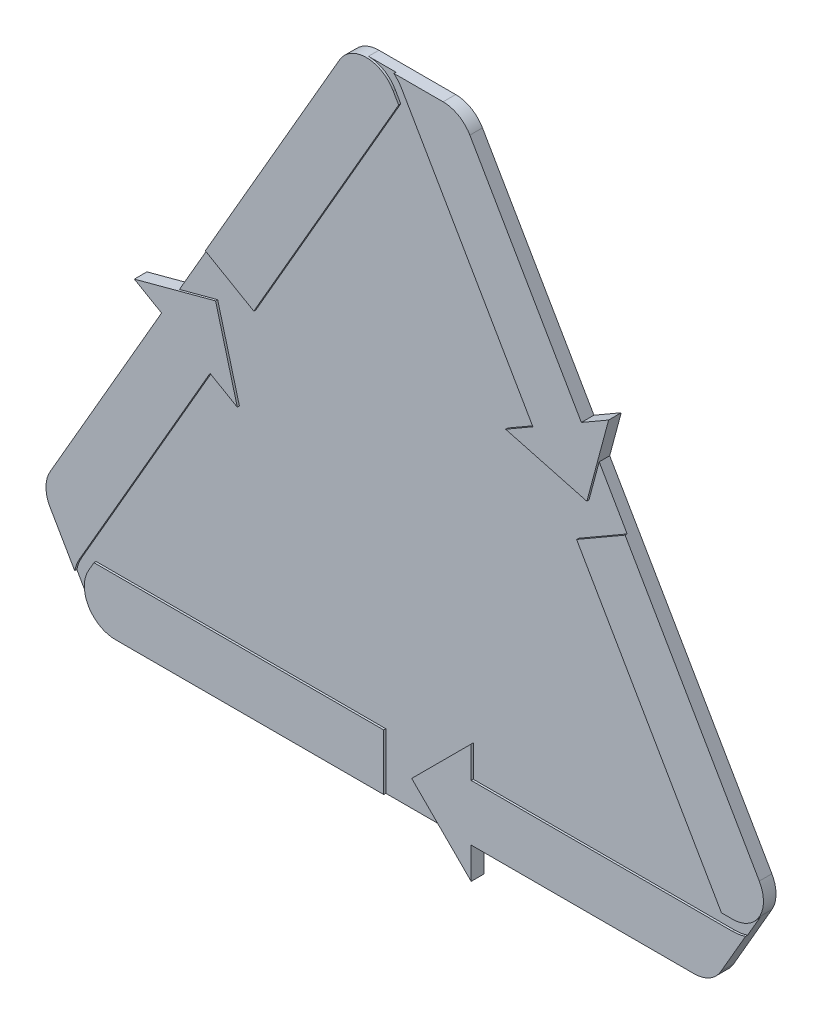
ISO-10303-21;
HEADER;
FILE_DESCRIPTION(('STEP AP214'),'2;1');
FILE_NAME('part.step','',(''),(''),'','','');
FILE_SCHEMA(('AUTOMOTIVE_DESIGN { 1 0 10303 214 1 1 1 1 }'));
ENDSEC;
DATA;
#1=APPLICATION_CONTEXT('core data for automotive mechanical design processes');
#2=APPLICATION_PROTOCOL_DEFINITION('international standard','automotive_design',2000,#1);
#3=PRODUCT_CONTEXT('',#1,'mechanical');
#4=PRODUCT('Part','Part','',(#3));
#5=PRODUCT_RELATED_PRODUCT_CATEGORY('part','',(#4));
#6=PRODUCT_DEFINITION_FORMATION('','',#4);
#7=PRODUCT_DEFINITION_CONTEXT('part definition',#1,'design');
#8=PRODUCT_DEFINITION('design','',#6,#7);
#9=PRODUCT_DEFINITION_SHAPE('','',#8);
#10=(LENGTH_UNIT() NAMED_UNIT(*) SI_UNIT(.MILLI.,.METRE.));
#11=(NAMED_UNIT(*) PLANE_ANGLE_UNIT() SI_UNIT($,.RADIAN.));
#12=(NAMED_UNIT(*) SI_UNIT($,.STERADIAN.) SOLID_ANGLE_UNIT());
#13=UNCERTAINTY_MEASURE_WITH_UNIT(LENGTH_MEASURE(1.E-05),#10,'distance_accuracy_value','');
#14=(GEOMETRIC_REPRESENTATION_CONTEXT(3) GLOBAL_UNCERTAINTY_ASSIGNED_CONTEXT((#13)) GLOBAL_UNIT_ASSIGNED_CONTEXT((#10,
#11,#12)) REPRESENTATION_CONTEXT('',''));
#15=CARTESIAN_POINT('',(0.,0.,0.));
#16=DIRECTION('',(0.,0.,1.));
#17=DIRECTION('',(1.,0.,0.));
#18=AXIS2_PLACEMENT_3D('',#15,#16,#17);
#19=CARTESIAN_POINT('',(-30.,17.3205080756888,-1.5));
#20=DIRECTION('',(-0.866025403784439,0.5,0.));
#21=DIRECTION('',(-0.5,-0.866025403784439,0.));
#22=AXIS2_PLACEMENT_3D('',#19,#20,#21);
#23=PLANE('',#22);
#24=DIRECTION('',(0.,0.,-1.));
#25=VECTOR('',#24,1.);
#26=CARTESIAN_POINT('',(-32.5000000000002,12.9903810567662,-1.5));
#27=LINE('',#26,#25);
#28=CARTESIAN_POINT('',(-32.5000000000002,12.9903810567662,0.));
#29=VERTEX_POINT('',#28);
#30=CARTESIAN_POINT('',(-32.5000000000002,12.9903810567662,-1.5));
#31=VERTEX_POINT('',#30);
#32=EDGE_CURVE('E401',#29,#31,#27,.T.);
#33=ORIENTED_EDGE('',*,*,#32,.F.);
#34=DIRECTION('',(-0.5,-0.866025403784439,0.));
#35=VECTOR('',#34,1.);
#36=CARTESIAN_POINT('',(-30.,17.3205080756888,0.));
#37=LINE('',#36,#35);
#38=CARTESIAN_POINT('',(-28.5000000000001,19.918584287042,0.));
#39=VERTEX_POINT('',#38);
#40=EDGE_CURVE('E672',#39,#29,#37,.T.);
#41=ORIENTED_EDGE('',*,*,#40,.F.);
#42=DIRECTION('',(0.,0.,-1.));
#43=VECTOR('',#42,1.);
#44=CARTESIAN_POINT('',(-28.5000000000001,19.918584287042,0.3));
#45=LINE('',#44,#43);
#46=CARTESIAN_POINT('',(-28.5000000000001,19.918584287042,0.3));
#47=VERTEX_POINT('',#46);
#48=EDGE_CURVE('E599',#47,#39,#45,.T.);
#49=ORIENTED_EDGE('',*,*,#48,.F.);
#50=DIRECTION('',(-0.499999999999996,-0.866025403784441,0.));
#51=VECTOR('',#50,1.);
#52=CARTESIAN_POINT('',(-30.0000000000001,17.3205080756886,0.3));
#53=LINE('',#52,#51);
#54=CARTESIAN_POINT('',(-9.31529988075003,53.1474596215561,0.3));
#55=VERTEX_POINT('',#54);
#56=EDGE_CURVE('E571',#55,#47,#53,.T.);
#57=ORIENTED_EDGE('',*,*,#56,.F.);
#58=DIRECTION('',(0.,0.,1.));
#59=VECTOR('',#58,1.);
#60=CARTESIAN_POINT('',(-9.31529988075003,53.1474596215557,-1.5));
#61=LINE('',#60,#59);
#62=CARTESIAN_POINT('',(-9.31529988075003,53.1474596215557,-1.5));
#63=VERTEX_POINT('',#62);
#64=EDGE_CURVE('E698',#63,#55,#61,.T.);
#65=ORIENTED_EDGE('',*,*,#64,.F.);
#66=DIRECTION('',(-0.5,-0.866025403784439,0.));
#67=VECTOR('',#66,1.);
#68=CARTESIAN_POINT('',(-30.,17.3205080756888,-1.5));
#69=LINE('',#68,#67);
#70=EDGE_CURVE('E104',#63,#31,#69,.T.);
#71=ORIENTED_EDGE('',*,*,#70,.T.);
#72=EDGE_LOOP('',(#33,#41,#49,#57,#65,#71));
#73=FACE_BOUND('',#72,.T.);
#74=ADVANCED_FACE('F81',(#73),#23,.T.);
#75=CARTESIAN_POINT('',(30.,17.3205080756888,-1.5));
#76=DIRECTION('',(0.866025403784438,0.5,0.));
#77=DIRECTION('',(-0.5,0.866025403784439,0.));
#78=AXIS2_PLACEMENT_3D('',#75,#76,#77);
#79=PLANE('',#78);
#80=DIRECTION('',(0.,0.,-1.));
#81=VECTOR('',#80,1.);
#82=CARTESIAN_POINT('',(27.4999999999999,21.6506350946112,-1.5));
#83=LINE('',#82,#81);
#84=CARTESIAN_POINT('',(27.4999999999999,21.6506350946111,0.));
#85=VERTEX_POINT('',#84);
#86=CARTESIAN_POINT('',(27.4999999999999,21.6506350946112,-1.5));
#87=VERTEX_POINT('',#86);
#88=EDGE_CURVE('E417',#85,#87,#83,.T.);
#89=ORIENTED_EDGE('',*,*,#88,.F.);
#90=DIRECTION('',(-0.5,0.866025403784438,0.));
#91=VECTOR('',#90,1.);
#92=CARTESIAN_POINT('',(30.,17.3205080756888,0.));
#93=LINE('',#92,#91);
#94=CARTESIAN_POINT('',(31.5,14.7224318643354,0.));
#95=VERTEX_POINT('',#94);
#96=EDGE_CURVE('E635',#95,#85,#93,.T.);
#97=ORIENTED_EDGE('',*,*,#96,.F.);
#98=DIRECTION('',(0.,0.,-1.));
#99=VECTOR('',#98,1.);
#100=CARTESIAN_POINT('',(31.5,14.7224318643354,0.3));
#101=LINE('',#100,#99);
#102=CARTESIAN_POINT('',(31.5,14.7224318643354,0.3));
#103=VERTEX_POINT('',#102);
#104=EDGE_CURVE('E633',#103,#95,#101,.T.);
#105=ORIENTED_EDGE('',*,*,#104,.F.);
#106=DIRECTION('',(-0.5,0.866025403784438,0.));
#107=VECTOR('',#106,1.);
#108=CARTESIAN_POINT('',(30.,17.3205080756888,0.3));
#109=LINE('',#108,#107);
#110=CARTESIAN_POINT('',(50.6847001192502,-18.5064434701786,0.3));
#111=VERTEX_POINT('',#110);
#112=EDGE_CURVE('E606',#111,#103,#109,.T.);
#113=ORIENTED_EDGE('',*,*,#112,.F.);
#114=DIRECTION('',(0.,0.,1.));
#115=VECTOR('',#114,1.);
#116=CARTESIAN_POINT('',(50.6847001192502,-18.5064434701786,-1.5));
#117=LINE('',#116,#115);
#118=CARTESIAN_POINT('',(50.6847001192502,-18.5064434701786,-1.5));
#119=VERTEX_POINT('',#118);
#120=EDGE_CURVE('E683',#119,#111,#117,.T.);
#121=ORIENTED_EDGE('',*,*,#120,.F.);
#122=DIRECTION('',(-0.5,0.866025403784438,0.));
#123=VECTOR('',#122,1.);
#124=CARTESIAN_POINT('',(30.,17.3205080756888,-1.5));
#125=LINE('',#124,#123);
#126=EDGE_CURVE('E636',#119,#87,#125,.T.);
#127=ORIENTED_EDGE('',*,*,#126,.T.);
#128=EDGE_LOOP('',(#89,#97,#105,#113,#121,#127));
#129=FACE_BOUND('',#128,.T.);
#130=ADVANCED_FACE('F805',(#129),#79,.T.);
#131=CARTESIAN_POINT('',(0.,-34.6410161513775,0.3));
#132=DIRECTION('',(0.,1.,0.));
#133=DIRECTION('',(-1.,0.,0.));
#134=AXIS2_PLACEMENT_3D('',#131,#132,#133);
#135=PLANE('',#134);
#136=DIRECTION('',(1.,0.,0.));
#137=VECTOR('',#136,1.);
#138=CARTESIAN_POINT('',(0.,-34.6410161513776,-1.5));
#139=LINE('',#138,#137);
#140=CARTESIAN_POINT('',(-41.3694002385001,-34.6410161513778,-1.5));
#141=VERTEX_POINT('',#140);
#142=CARTESIAN_POINT('',(5.00000000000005,-34.6410161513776,-1.5));
#143=VERTEX_POINT('',#142);
#144=EDGE_CURVE('E657',#141,#143,#139,.T.);
#145=ORIENTED_EDGE('',*,*,#144,.T.);
#146=DIRECTION('',(0.,0.,1.));
#147=VECTOR('',#146,1.);
#148=CARTESIAN_POINT('',(5.00000000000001,-34.6410161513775,0.3));
#149=LINE('',#148,#147);
#150=CARTESIAN_POINT('',(5.00000000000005,-34.6410161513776,0.));
#151=VERTEX_POINT('',#150);
#152=EDGE_CURVE('E426',#143,#151,#149,.T.);
#153=ORIENTED_EDGE('',*,*,#152,.T.);
#154=DIRECTION('',(1.,0.,0.));
#155=VECTOR('',#154,1.);
#156=CARTESIAN_POINT('',(0.,-34.6410161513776,0.));
#157=LINE('',#156,#155);
#158=CARTESIAN_POINT('',(-2.99999999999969,-34.6410161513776,0.));
#159=VERTEX_POINT('',#158);
#160=EDGE_CURVE('E677',#159,#151,#157,.T.);
#161=ORIENTED_EDGE('',*,*,#160,.F.);
#162=DIRECTION('',(0.,0.,-1.));
#163=VECTOR('',#162,1.);
#164=CARTESIAN_POINT('',(-2.99999999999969,-34.6410161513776,0.3));
#165=LINE('',#164,#163);
#166=CARTESIAN_POINT('',(-2.99999999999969,-34.6410161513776,0.3));
#167=VERTEX_POINT('',#166);
#168=EDGE_CURVE('E564',#167,#159,#165,.T.);
#169=ORIENTED_EDGE('',*,*,#168,.F.);
#170=DIRECTION('',(1.,0.,0.));
#171=VECTOR('',#170,1.);
#172=CARTESIAN_POINT('',(3.36536354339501E-13,-34.6410161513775,0.3));
#173=LINE('',#172,#171);
#174=CARTESIAN_POINT('',(-41.3694002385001,-34.6410161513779,0.3));
#175=VERTEX_POINT('',#174);
#176=EDGE_CURVE('E536',#175,#167,#173,.T.);
#177=ORIENTED_EDGE('',*,*,#176,.F.);
#178=DIRECTION('',(0.,0.,1.));
#179=VECTOR('',#178,1.);
#180=CARTESIAN_POINT('',(-41.3694002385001,-34.6410161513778,-1.5));
#181=LINE('',#180,#179);
#182=EDGE_CURVE('E689',#141,#175,#181,.T.);
#183=ORIENTED_EDGE('',*,*,#182,.F.);
#184=EDGE_LOOP('',(#145,#153,#161,#169,#177,#183));
#185=FACE_BOUND('',#184,.T.);
#186=ADVANCED_FACE('F811',(#185),#135,.F.);
#187=CARTESIAN_POINT('',(0.,0.,0.));
#188=DIRECTION('',(0.,0.,1.));
#189=DIRECTION('',(1.,0.,0.));
#190=AXIS2_PLACEMENT_3D('',#187,#188,#189);
#191=PLANE('',#190);
#192=DIRECTION('',(0.965925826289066,0.258819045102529,0.));
#193=VECTOR('',#192,1.);
#194=CARTESIAN_POINT('',(-5.42468245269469,20.2451905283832,0.));
#195=LINE('',#194,#193);
#196=CARTESIAN_POINT('',(-27.0358983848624,14.4544826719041,0.));
#197=VERTEX_POINT('',#196);
#198=EDGE_CURVE('E429',#29,#197,#195,.T.);
#199=ORIENTED_EDGE('',*,*,#198,.T.);
#200=DIRECTION('',(0.25881904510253,-0.965925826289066,0.));
#201=VECTOR('',#200,1.);
#202=CARTESIAN_POINT('',(-21.6112159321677,-5.79070785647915,0.));
#203=LINE('',#202,#201);
#204=CARTESIAN_POINT('',(-23.9246824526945,2.84326673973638,0.));
#205=VERTEX_POINT('',#204);
#206=EDGE_CURVE('E432',#197,#205,#203,.T.);
#207=ORIENTED_EDGE('',*,*,#206,.T.);
#208=DIRECTION('',(-0.866025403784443,0.499999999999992,0.));
#209=VECTOR('',#208,1.);
#210=CARTESIAN_POINT('',(-4.74999999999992,-8.22724133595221,0.));
#211=LINE('',#210,#209);
#212=CARTESIAN_POINT('',(-27.8217967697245,5.09326673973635,0.));
#213=VERTEX_POINT('',#212);
#214=EDGE_CURVE('E460',#205,#213,#211,.T.);
#215=ORIENTED_EDGE('',*,*,#214,.T.);
#216=DIRECTION('',(-0.499999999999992,-0.866025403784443,0.));
#217=VECTOR('',#216,1.);
#218=CARTESIAN_POINT('',(-23.0717967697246,13.3205080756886,0.));
#219=LINE('',#218,#217);
#220=CARTESIAN_POINT('',(-46.4989106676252,-27.256443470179,0.));
#221=VERTEX_POINT('',#220);
#222=EDGE_CURVE('E458',#213,#221,#219,.T.);
#223=ORIENTED_EDGE('',*,*,#222,.T.);
#224=CARTESIAN_POINT('',(-41.3694002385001,-30.2179676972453,0.));
#225=DIRECTION('',(0.,0.,1.));
#226=DIRECTION('',(-0.499999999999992,-0.866025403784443,0.));
#227=AXIS2_PLACEMENT_3D('',#224,#225,#226);
#228=CIRCLE('',#227,5.92304845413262);
#229=CARTESIAN_POINT('',(-47.1695898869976,-29.0178414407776,0.));
#230=VERTEX_POINT('',#229);
#231=EDGE_CURVE('E456',#221,#230,#228,.T.);
#232=ORIENTED_EDGE('',*,*,#231,.T.);
#233=DIRECTION('',(0.500000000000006,-0.866025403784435,0.));
#234=VECTOR('',#233,1.);
#235=CARTESIAN_POINT('',(-47.9422863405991,-27.6794919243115,0.));
#236=LINE('',#235,#234);
#237=CARTESIAN_POINT('',(-45.1998725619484,-32.4294919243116,0.));
#238=VERTEX_POINT('',#237);
#239=EDGE_CURVE('E675',#230,#238,#236,.T.);
#240=ORIENTED_EDGE('',*,*,#239,.T.);
#241=CARTESIAN_POINT('',(-41.3694002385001,-30.2179676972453,0.));
#242=DIRECTION('',(0.,0.,1.));
#243=DIRECTION('',(-0.499999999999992,-0.866025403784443,0.));
#244=AXIS2_PLACEMENT_3D('',#241,#242,#243);
#245=CIRCLE('',#244,4.42304845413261);
#246=CARTESIAN_POINT('',(-45.1998725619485,-28.006443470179,0.));
#247=VERTEX_POINT('',#246);
#248=EDGE_CURVE('E532',#247,#238,#245,.T.);
#249=ORIENTED_EDGE('',*,*,#248,.F.);
#250=DIRECTION('',(-0.499999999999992,-0.866025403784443,0.));
#251=VECTOR('',#250,1.);
#252=CARTESIAN_POINT('',(-21.7727586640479,12.5705080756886,0.));
#253=LINE('',#252,#251);
#254=CARTESIAN_POINT('',(-44.4115427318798,-26.6410161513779,0.));
#255=VERTEX_POINT('',#254);
#256=EDGE_CURVE('E537',#255,#247,#253,.T.);
#257=ORIENTED_EDGE('',*,*,#256,.F.);
#258=DIRECTION('',(1.,0.,0.));
#259=VECTOR('',#258,1.);
#260=CARTESIAN_POINT('',(2.39391839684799E-13,-26.6410161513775,0.));
#261=LINE('',#260,#259);
#262=CARTESIAN_POINT('',(-2.99999999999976,-26.6410161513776,0.));
#263=VERTEX_POINT('',#262);
#264=EDGE_CURVE('E552',#255,#263,#261,.T.);
#265=ORIENTED_EDGE('',*,*,#264,.T.);
#266=DIRECTION('',(0.,-1.,0.));
#267=VECTOR('',#266,1.);
#268=CARTESIAN_POINT('',(-3.,0.,0.));
#269=LINE('',#268,#267);
#270=EDGE_CURVE('E550',#263,#159,#269,.T.);
#271=ORIENTED_EDGE('',*,*,#270,.T.);
#272=ORIENTED_EDGE('',*,*,#160,.T.);
#273=DIRECTION('',(-0.707106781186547,0.707106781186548,0.));
#274=VECTOR('',#273,1.);
#275=CARTESIAN_POINT('',(-14.8205080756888,-14.8205080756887,0.));
#276=LINE('',#275,#274);
#277=CARTESIAN_POINT('',(1.,-30.6410161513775,0.));
#278=VERTEX_POINT('',#277);
#279=EDGE_CURVE('E685',#151,#278,#276,.T.);
#280=ORIENTED_EDGE('',*,*,#279,.T.);
#281=DIRECTION('',(0.707106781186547,0.707106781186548,0.));
#282=VECTOR('',#281,1.);
#283=CARTESIAN_POINT('',(15.8205080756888,-15.8205080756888,0.));
#284=LINE('',#283,#282);
#285=CARTESIAN_POINT('',(9.49999999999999,-22.1410161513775,0.));
#286=VERTEX_POINT('',#285);
#287=EDGE_CURVE('E710',#278,#286,#284,.T.);
#288=ORIENTED_EDGE('',*,*,#287,.T.);
#289=DIRECTION('',(0.,-1.,0.));
#290=VECTOR('',#289,1.);
#291=CARTESIAN_POINT('',(9.5,0.,0.));
#292=LINE('',#291,#290);
#293=CARTESIAN_POINT('',(9.5,-26.6410161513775,0.));
#294=VERTEX_POINT('',#293);
#295=EDGE_CURVE('E737',#286,#294,#292,.T.);
#296=ORIENTED_EDGE('',*,*,#295,.T.);
#297=DIRECTION('',(1.,0.,0.));
#298=VECTOR('',#297,1.);
#299=CARTESIAN_POINT('',(0.,-26.6410161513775,0.));
#300=LINE('',#299,#298);
#301=CARTESIAN_POINT('',(46.8542277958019,-26.6410161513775,0.));
#302=VERTEX_POINT('',#301);
#303=EDGE_CURVE('E735',#294,#302,#300,.T.);
#304=ORIENTED_EDGE('',*,*,#303,.T.);
#305=CARTESIAN_POINT('',(46.8542277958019,-20.7179676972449,0.));
#306=DIRECTION('',(0.,0.,1.));
#307=DIRECTION('',(1.,0.,0.));
#308=AXIS2_PLACEMENT_3D('',#305,#306,#307);
#309=CIRCLE('',#308,5.92304845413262);
#310=CARTESIAN_POINT('',(48.7149827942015,-26.3411424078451,0.));
#311=VERTEX_POINT('',#310);
#312=EDGE_CURVE('E733',#302,#311,#309,.T.);
#313=ORIENTED_EDGE('',*,*,#312,.T.);
#314=DIRECTION('',(0.499999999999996,0.866025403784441,0.));
#315=VECTOR('',#314,1.);
#316=CARTESIAN_POINT('',(47.9422863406,-27.6794919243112,0.));
#317=LINE('',#316,#315);
#318=CARTESIAN_POINT('',(50.6847001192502,-22.9294919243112,0.));
#319=VERTEX_POINT('',#318);
#320=EDGE_CURVE('E680',#311,#319,#317,.T.);
#321=ORIENTED_EDGE('',*,*,#320,.T.);
#322=CARTESIAN_POINT('',(46.8542277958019,-20.7179676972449,0.));
#323=DIRECTION('',(0.,0.,1.));
#324=DIRECTION('',(1.,0.,0.));
#325=AXIS2_PLACEMENT_3D('',#322,#323,#324);
#326=CIRCLE('',#325,4.42304845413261);
#327=CARTESIAN_POINT('',(46.8542277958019,-25.1410161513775,0.));
#328=VERTEX_POINT('',#327);
#329=EDGE_CURVE('E602',#328,#319,#326,.T.);
#330=ORIENTED_EDGE('',*,*,#329,.F.);
#331=DIRECTION('',(1.,0.,0.));
#332=VECTOR('',#331,1.);
#333=CARTESIAN_POINT('',(0.,-25.1410161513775,0.));
#334=LINE('',#333,#332);
#335=CARTESIAN_POINT('',(45.2775681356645,-25.1410161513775,0.));
#336=VERTEX_POINT('',#335);
#337=EDGE_CURVE('E607',#336,#328,#334,.T.);
#338=ORIENTED_EDGE('',*,*,#337,.F.);
#339=DIRECTION('',(-0.5,0.866025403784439,0.));
#340=VECTOR('',#339,1.);
#341=CARTESIAN_POINT('',(23.0717967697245,13.3205080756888,0.));
#342=LINE('',#341,#340);
#343=CARTESIAN_POINT('',(24.5717967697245,10.7224318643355,0.));
#344=VERTEX_POINT('',#343);
#345=EDGE_CURVE('E622',#336,#344,#342,.T.);
#346=ORIENTED_EDGE('',*,*,#345,.T.);
#347=DIRECTION('',(0.866025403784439,0.5,0.));
#348=VECTOR('',#347,1.);
#349=CARTESIAN_POINT('',(1.5,-2.59807621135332,0.));
#350=LINE('',#349,#348);
#351=EDGE_CURVE('E619',#344,#95,#350,.T.);
#352=ORIENTED_EDGE('',*,*,#351,.T.);
#353=ORIENTED_EDGE('',*,*,#96,.T.);
#354=DIRECTION('',(-0.258819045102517,-0.96592582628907,0.));
#355=VECTOR('',#354,1.);
#356=CARTESIAN_POINT('',(20.2451905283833,-5.42468245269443,0.));
#357=LINE('',#356,#355);
#358=CARTESIAN_POINT('',(26.0358983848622,16.1865334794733,0.));
#359=VERTEX_POINT('',#358);
#360=EDGE_CURVE('E396',#85,#359,#357,.T.);
#361=ORIENTED_EDGE('',*,*,#360,.T.);
#362=DIRECTION('',(-0.96592582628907,0.258819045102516,0.));
#363=VECTOR('',#362,1.);
#364=CARTESIAN_POINT('',(5.79070785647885,21.6112159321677,0.));
#365=LINE('',#364,#363);
#366=CARTESIAN_POINT('',(14.4246824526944,19.297749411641,0.));
#367=VERTEX_POINT('',#366);
#368=EDGE_CURVE('E482',#359,#367,#365,.T.);
#369=ORIENTED_EDGE('',*,*,#368,.T.);
#370=DIRECTION('',(0.866025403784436,0.500000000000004,0.));
#371=VECTOR('',#370,1.);
#372=CARTESIAN_POINT('',(-4.75000000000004,8.22724133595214,0.));
#373=LINE('',#372,#371);
#374=CARTESIAN_POINT('',(18.3217967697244,21.547749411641,0.));
#375=VERTEX_POINT('',#374);
#376=EDGE_CURVE('E511',#367,#375,#373,.T.);
#377=ORIENTED_EDGE('',*,*,#376,.T.);
#378=DIRECTION('',(-0.500000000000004,0.866025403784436,0.));
#379=VECTOR('',#378,1.);
#380=CARTESIAN_POINT('',(23.0717967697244,13.3205080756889,0.));
#381=LINE('',#380,#379);
#382=CARTESIAN_POINT('',(-0.355317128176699,53.8974596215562,0.));
#383=VERTEX_POINT('',#382);
#384=EDGE_CURVE('E509',#375,#383,#381,.T.);
#385=ORIENTED_EDGE('',*,*,#384,.T.);
#386=CARTESIAN_POINT('',(-5.48482755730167,50.9359353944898,0.));
#387=DIRECTION('',(0.,0.,1.));
#388=DIRECTION('',(-0.500000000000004,0.866025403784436,0.));
#389=AXIS2_PLACEMENT_3D('',#386,#387,#388);
#390=CIRCLE('',#389,5.92304845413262);
#391=CARTESIAN_POINT('',(-1.54539290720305,55.3589838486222,0.));
#392=VERTEX_POINT('',#391);
#393=EDGE_CURVE('E507',#383,#392,#390,.T.);
#394=ORIENTED_EDGE('',*,*,#393,.T.);
#395=DIRECTION('',(-1.,0.,0.));
#396=VECTOR('',#395,1.);
#397=CARTESIAN_POINT('',(-1.48228373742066E-13,55.3589838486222,0.));
#398=LINE('',#397,#396);
#399=CARTESIAN_POINT('',(-5.48482755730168,55.3589838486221,0.));
#400=VERTEX_POINT('',#399);
#401=EDGE_CURVE('E670',#392,#400,#398,.T.);
#402=ORIENTED_EDGE('',*,*,#401,.T.);
#403=CARTESIAN_POINT('',(-5.48482755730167,50.9359353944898,0.));
#404=DIRECTION('',(0.,0.,1.));
#405=DIRECTION('',(-0.500000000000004,0.866025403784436,0.));
#406=AXIS2_PLACEMENT_3D('',#403,#404,#405);
#407=CIRCLE('',#406,4.42304845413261);
#408=CARTESIAN_POINT('',(-1.65435523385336,53.1474596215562,0.));
#409=VERTEX_POINT('',#408);
#410=EDGE_CURVE('E567',#409,#400,#407,.T.);
#411=ORIENTED_EDGE('',*,*,#410,.F.);
#412=DIRECTION('',(-0.500000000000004,0.866025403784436,0.));
#413=VECTOR('',#412,1.);
#414=CARTESIAN_POINT('',(21.7727586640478,12.5705080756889,0.));
#415=LINE('',#414,#413);
#416=CARTESIAN_POINT('',(-0.866025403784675,51.7820323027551,0.));
#417=VERTEX_POINT('',#416);
#418=EDGE_CURVE('E572',#417,#409,#415,.T.);
#419=ORIENTED_EDGE('',*,*,#418,.F.);
#420=DIRECTION('',(-0.499999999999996,-0.866025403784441,0.));
#421=VECTOR('',#420,1.);
#422=CARTESIAN_POINT('',(-23.0717967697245,13.3205080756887,0.));
#423=LINE('',#422,#421);
#424=CARTESIAN_POINT('',(-21.5717967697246,15.918584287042,0.));
#425=VERTEX_POINT('',#424);
#426=EDGE_CURVE('E587',#417,#425,#423,.T.);
#427=ORIENTED_EDGE('',*,*,#426,.T.);
#428=DIRECTION('',(-0.866025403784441,0.499999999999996,0.));
#429=VECTOR('',#428,1.);
#430=CARTESIAN_POINT('',(1.49999999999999,2.59807621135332,0.));
#431=LINE('',#430,#429);
#432=EDGE_CURVE('E585',#425,#39,#431,.T.);
#433=ORIENTED_EDGE('',*,*,#432,.T.);
#434=ORIENTED_EDGE('',*,*,#40,.T.);
#435=EDGE_LOOP('',(#199,#207,#215,#223,#232,#240,#249,#257,#265,#271,#272,#280,#288,#296,#304,
#313,#321,#330,#338,#346,#352,#353,#361,#369,#377,#385,#394,#402,#411,#419,#427,#433,#434));
#436=FACE_BOUND('',#435,.T.);
#437=ADVANCED_FACE('F800',(#436),#191,.T.);
#438=CARTESIAN_POINT('',(-14.8205080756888,-14.8205080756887,0.3));
#439=DIRECTION('',(-0.707106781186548,-0.707106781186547,0.));
#440=DIRECTION('',(0.707106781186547,-0.707106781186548,0.));
#441=AXIS2_PLACEMENT_3D('',#438,#439,#440);
#442=PLANE('',#441);
#443=ORIENTED_EDGE('',*,*,#279,.F.);
#444=ORIENTED_EDGE('',*,*,#152,.F.);
#445=DIRECTION('',(0.707106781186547,-0.707106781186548,0.));
#446=VECTOR('',#445,1.);
#447=CARTESIAN_POINT('',(1.,-30.6410161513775,-1.5));
#448=LINE('',#447,#446);
#449=CARTESIAN_POINT('',(9.5,-39.1410161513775,-1.5));
#450=VERTEX_POINT('',#449);
#451=EDGE_CURVE('E420',#143,#450,#448,.T.);
#452=ORIENTED_EDGE('',*,*,#451,.T.);
#453=DIRECTION('',(0.,0.,-1.));
#454=VECTOR('',#453,1.);
#455=CARTESIAN_POINT('',(9.5,-39.1410161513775,0.3));
#456=LINE('',#455,#454);
#457=CARTESIAN_POINT('',(9.5,-39.1410161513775,0.3));
#458=VERTEX_POINT('',#457);
#459=EDGE_CURVE('E12',#458,#450,#456,.T.);
#460=ORIENTED_EDGE('',*,*,#459,.F.);
#461=DIRECTION('',(-0.707106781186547,0.707106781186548,0.));
#462=VECTOR('',#461,1.);
#463=CARTESIAN_POINT('',(-14.8205080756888,-14.8205080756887,0.3));
#464=LINE('',#463,#462);
#465=CARTESIAN_POINT('',(1.,-30.6410161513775,0.3));
#466=VERTEX_POINT('',#465);
#467=EDGE_CURVE('E706',#458,#466,#464,.T.);
#468=ORIENTED_EDGE('',*,*,#467,.T.);
#469=DIRECTION('',(0.,0.,-1.));
#470=VECTOR('',#469,1.);
#471=CARTESIAN_POINT('',(1.,-30.6410161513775,0.3));
#472=LINE('',#471,#470);
#473=EDGE_CURVE('E731',#466,#278,#472,.T.);
#474=ORIENTED_EDGE('',*,*,#473,.T.);
#475=EDGE_LOOP('',(#443,#444,#452,#460,#468,#474));
#476=FACE_BOUND('',#475,.T.);
#477=ADVANCED_FACE('F83',(#476),#442,.T.);
#478=CARTESIAN_POINT('',(9.5,0.,0.3));
#479=DIRECTION('',(1.,0.,0.));
#480=DIRECTION('',(0.,0.,-1.));
#481=AXIS2_PLACEMENT_3D('',#478,#479,#480);
#482=PLANE('',#481);
#483=ORIENTED_EDGE('',*,*,#459,.T.);
#484=DIRECTION('',(0.,1.,0.));
#485=VECTOR('',#484,1.);
#486=CARTESIAN_POINT('',(9.5,-39.1410161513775,-1.5));
#487=LINE('',#486,#485);
#488=CARTESIAN_POINT('',(9.5,-34.6410161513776,-1.5));
#489=VERTEX_POINT('',#488);
#490=EDGE_CURVE('E423',#450,#489,#487,.T.);
#491=ORIENTED_EDGE('',*,*,#490,.T.);
#492=DIRECTION('',(0.,0.,-1.));
#493=VECTOR('',#492,1.);
#494=CARTESIAN_POINT('',(9.5,-34.6410161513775,0.3));
#495=LINE('',#494,#493);
#496=CARTESIAN_POINT('',(9.5,-34.6410161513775,0.3));
#497=VERTEX_POINT('',#496);
#498=EDGE_CURVE('E89',#497,#489,#495,.T.);
#499=ORIENTED_EDGE('',*,*,#498,.F.);
#500=DIRECTION('',(0.,-1.,0.));
#501=VECTOR('',#500,1.);
#502=CARTESIAN_POINT('',(9.5,0.,0.3));
#503=LINE('',#502,#501);
#504=EDGE_CURVE('E709',#497,#458,#503,.T.);
#505=ORIENTED_EDGE('',*,*,#504,.T.);
#506=EDGE_LOOP('',(#483,#491,#499,#505));
#507=FACE_BOUND('',#506,.T.);
#508=ADVANCED_FACE('F769',(#507),#482,.T.);
#509=ORIENTED_EDGE('',*,*,#498,.T.);
#510=CARTESIAN_POINT('',(41.3694002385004,-34.6410161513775,-1.5));
#511=VERTEX_POINT('',#510);
#512=EDGE_CURVE('E656',#489,#511,#139,.T.);
#513=ORIENTED_EDGE('',*,*,#512,.T.);
#514=DIRECTION('',(0.,0.,-1.));
#515=VECTOR('',#514,1.);
#516=CARTESIAN_POINT('',(41.3694002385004,-34.6410161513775,0.3));
#517=LINE('',#516,#515);
#518=CARTESIAN_POINT('',(41.3694002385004,-34.6410161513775,0.3));
#519=VERTEX_POINT('',#518);
#520=EDGE_CURVE('E756',#519,#511,#517,.T.);
#521=ORIENTED_EDGE('',*,*,#520,.F.);
#522=DIRECTION('',(1.,0.,0.));
#523=VECTOR('',#522,1.);
#524=CARTESIAN_POINT('',(0.,-34.6410161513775,0.3));
#525=LINE('',#524,#523);
#526=EDGE_CURVE('E713',#497,#519,#525,.T.);
#527=ORIENTED_EDGE('',*,*,#526,.F.);
#528=EDGE_LOOP('',(#509,#513,#521,#527));
#529=FACE_BOUND('',#528,.T.);
#530=ADVANCED_FACE('F761',(#529),#135,.F.);
#531=CARTESIAN_POINT('',(41.3694002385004,-30.2179676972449,0.3));
#532=DIRECTION('',(0.,0.,-1.));
#533=DIRECTION('',(-1.,0.,0.));
#534=AXIS2_PLACEMENT_3D('',#531,#532,#533);
#535=CYLINDRICAL_SURFACE('',#534,4.42304845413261);
#536=ORIENTED_EDGE('',*,*,#520,.T.);
#537=CARTESIAN_POINT('',(41.3694002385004,-30.2179676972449,-1.5));
#538=DIRECTION('',(0.,0.,1.));
#539=DIRECTION('',(1.,0.,0.));
#540=AXIS2_PLACEMENT_3D('',#537,#538,#539);
#541=CIRCLE('',#540,4.42304845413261);
#542=CARTESIAN_POINT('',(45.199872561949,-32.4294919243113,-1.5));
#543=VERTEX_POINT('',#542);
#544=EDGE_CURVE('E659',#511,#543,#541,.T.);
#545=ORIENTED_EDGE('',*,*,#544,.T.);
#546=DIRECTION('',(0.,0.,-1.));
#547=VECTOR('',#546,1.);
#548=CARTESIAN_POINT('',(45.1998725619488,-32.4294919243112,0.3));
#549=LINE('',#548,#547);
#550=CARTESIAN_POINT('',(45.1998725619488,-32.4294919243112,0.3));
#551=VERTEX_POINT('',#550);
#552=EDGE_CURVE('E754',#551,#543,#549,.T.);
#553=ORIENTED_EDGE('',*,*,#552,.F.);
#554=CARTESIAN_POINT('',(41.3694002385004,-30.2179676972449,0.3));
#555=DIRECTION('',(0.,0.,1.));
#556=DIRECTION('',(1.,0.,0.));
#557=AXIS2_PLACEMENT_3D('',#554,#555,#556);
#558=CIRCLE('',#557,4.42304845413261);
#559=EDGE_CURVE('E715',#519,#551,#558,.T.);
#560=ORIENTED_EDGE('',*,*,#559,.F.);
#561=EDGE_LOOP('',(#536,#545,#553,#560));
#562=FACE_BOUND('',#561,.T.);
#563=ADVANCED_FACE('F1053',(#562),#535,.T.);
#564=CARTESIAN_POINT('',(47.9422863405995,-27.6794919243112,0.3));
#565=DIRECTION('',(-0.866025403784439,0.5,0.));
#566=DIRECTION('',(-0.5,-0.866025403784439,0.));
#567=AXIS2_PLACEMENT_3D('',#564,#565,#566);
#568=PLANE('',#567);
#569=ORIENTED_EDGE('',*,*,#552,.T.);
#570=DIRECTION('',(0.499999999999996,0.866025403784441,0.));
#571=VECTOR('',#570,1.);
#572=CARTESIAN_POINT('',(47.9422863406,-27.6794919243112,-1.5));
#573=LINE('',#572,#571);
#574=CARTESIAN_POINT('',(50.6847001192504,-22.9294919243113,-1.5));
#575=VERTEX_POINT('',#574);
#576=EDGE_CURVE('E662',#543,#575,#573,.T.);
#577=ORIENTED_EDGE('',*,*,#576,.T.);
#578=DIRECTION('',(0.,0.,1.));
#579=VECTOR('',#578,1.);
#580=CARTESIAN_POINT('',(50.6847001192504,-22.9294919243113,-1.5));
#581=LINE('',#580,#579);
#582=EDGE_CURVE('E686',#575,#319,#581,.T.);
#583=ORIENTED_EDGE('',*,*,#582,.T.);
#584=ORIENTED_EDGE('',*,*,#320,.F.);
#585=DIRECTION('',(0.,0.,-1.));
#586=VECTOR('',#585,1.);
#587=CARTESIAN_POINT('',(48.7149827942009,-26.3411424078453,0.3));
#588=LINE('',#587,#586);
#589=CARTESIAN_POINT('',(48.7149827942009,-26.3411424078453,0.3));
#590=VERTEX_POINT('',#589);
#591=EDGE_CURVE('E751',#590,#311,#588,.T.);
#592=ORIENTED_EDGE('',*,*,#591,.F.);
#593=DIRECTION('',(0.5,0.866025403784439,0.));
#594=VECTOR('',#593,1.);
#595=CARTESIAN_POINT('',(47.9422863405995,-27.6794919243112,0.3));
#596=LINE('',#595,#594);
#597=EDGE_CURVE('E717',#551,#590,#596,.T.);
#598=ORIENTED_EDGE('',*,*,#597,.F.);
#599=EDGE_LOOP('',(#569,#577,#583,#584,#592,#598));
#600=FACE_BOUND('',#599,.T.);
#601=ADVANCED_FACE('F1063',(#600),#568,.F.);
#602=CARTESIAN_POINT('',(46.8542277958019,-20.7179676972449,0.3));
#603=DIRECTION('',(0.,0.,-1.));
#604=DIRECTION('',(-1.,0.,0.));
#605=AXIS2_PLACEMENT_3D('',#602,#603,#604);
#606=CYLINDRICAL_SURFACE('',#605,5.92304845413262);
#607=ORIENTED_EDGE('',*,*,#312,.F.);
#608=DIRECTION('',(0.,0.,-1.));
#609=VECTOR('',#608,1.);
#610=CARTESIAN_POINT('',(46.8542277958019,-26.6410161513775,0.3));
#611=LINE('',#610,#609);
#612=CARTESIAN_POINT('',(46.8542277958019,-26.6410161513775,0.3));
#613=VERTEX_POINT('',#612);
#614=EDGE_CURVE('E748',#613,#302,#611,.T.);
#615=ORIENTED_EDGE('',*,*,#614,.F.);
#616=CARTESIAN_POINT('',(46.8542277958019,-20.7179676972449,0.3));
#617=DIRECTION('',(0.,0.,1.));
#618=DIRECTION('',(1.,0.,0.));
#619=AXIS2_PLACEMENT_3D('',#616,#617,#618);
#620=CIRCLE('',#619,5.92304845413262);
#621=EDGE_CURVE('E719',#613,#590,#620,.T.);
#622=ORIENTED_EDGE('',*,*,#621,.T.);
#623=ORIENTED_EDGE('',*,*,#591,.T.);
#624=EDGE_LOOP('',(#607,#615,#622,#623));
#625=FACE_BOUND('',#624,.T.);
#626=ADVANCED_FACE('F1074',(#625),#606,.F.);
#627=CARTESIAN_POINT('',(0.,-26.6410161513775,0.3));
#628=DIRECTION('',(0.,1.,0.));
#629=DIRECTION('',(0.,0.,1.));
#630=AXIS2_PLACEMENT_3D('',#627,#628,#629);
#631=PLANE('',#630);
#632=ORIENTED_EDGE('',*,*,#303,.F.);
#633=DIRECTION('',(0.,0.,-1.));
#634=VECTOR('',#633,1.);
#635=CARTESIAN_POINT('',(9.5,-26.6410161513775,0.3));
#636=LINE('',#635,#634);
#637=CARTESIAN_POINT('',(9.5,-26.6410161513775,0.3));
#638=VERTEX_POINT('',#637);
#639=EDGE_CURVE('E745',#638,#294,#636,.T.);
#640=ORIENTED_EDGE('',*,*,#639,.F.);
#641=DIRECTION('',(1.,0.,0.));
#642=VECTOR('',#641,1.);
#643=CARTESIAN_POINT('',(0.,-26.6410161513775,0.3));
#644=LINE('',#643,#642);
#645=EDGE_CURVE('E722',#638,#613,#644,.T.);
#646=ORIENTED_EDGE('',*,*,#645,.T.);
#647=ORIENTED_EDGE('',*,*,#614,.T.);
#648=EDGE_LOOP('',(#632,#640,#646,#647));
#649=FACE_BOUND('',#648,.T.);
#650=ADVANCED_FACE('F1086',(#649),#631,.T.);
#651=CARTESIAN_POINT('',(9.5,0.,0.3));
#652=DIRECTION('',(1.,0.,0.));
#653=DIRECTION('',(0.,0.,-1.));
#654=AXIS2_PLACEMENT_3D('',#651,#652,#653);
#655=PLANE('',#654);
#656=ORIENTED_EDGE('',*,*,#295,.F.);
#657=DIRECTION('',(0.,0.,-1.));
#658=VECTOR('',#657,1.);
#659=CARTESIAN_POINT('',(9.49999999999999,-22.1410161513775,0.3));
#660=LINE('',#659,#658);
#661=CARTESIAN_POINT('',(9.49999999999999,-22.1410161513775,0.3));
#662=VERTEX_POINT('',#661);
#663=EDGE_CURVE('E742',#662,#286,#660,.T.);
#664=ORIENTED_EDGE('',*,*,#663,.F.);
#665=DIRECTION('',(0.,-1.,0.));
#666=VECTOR('',#665,1.);
#667=CARTESIAN_POINT('',(9.5,0.,0.3));
#668=LINE('',#667,#666);
#669=EDGE_CURVE('E725',#662,#638,#668,.T.);
#670=ORIENTED_EDGE('',*,*,#669,.T.);
#671=ORIENTED_EDGE('',*,*,#639,.T.);
#672=EDGE_LOOP('',(#656,#664,#670,#671));
#673=FACE_BOUND('',#672,.T.);
#674=ADVANCED_FACE('F1096',(#673),#655,.T.);
#675=CARTESIAN_POINT('',(15.8205080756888,-15.8205080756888,0.3));
#676=DIRECTION('',(-0.707106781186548,0.707106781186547,0.));
#677=DIRECTION('',(-0.707106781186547,-0.707106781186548,0.));
#678=AXIS2_PLACEMENT_3D('',#675,#676,#677);
#679=PLANE('',#678);
#680=ORIENTED_EDGE('',*,*,#287,.F.);
#681=ORIENTED_EDGE('',*,*,#473,.F.);
#682=DIRECTION('',(0.707106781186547,0.707106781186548,0.));
#683=VECTOR('',#682,1.);
#684=CARTESIAN_POINT('',(15.8205080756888,-15.8205080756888,0.3));
#685=LINE('',#684,#683);
#686=EDGE_CURVE('E728',#466,#662,#685,.T.);
#687=ORIENTED_EDGE('',*,*,#686,.T.);
#688=ORIENTED_EDGE('',*,*,#663,.T.);
#689=EDGE_LOOP('',(#680,#681,#687,#688));
#690=FACE_BOUND('',#689,.T.);
#691=ADVANCED_FACE('F1111',(#690),#679,.T.);
#692=CARTESIAN_POINT('',(0.,0.,0.3));
#693=DIRECTION('',(0.,0.,1.));
#694=DIRECTION('',(1.,0.,0.));
#695=AXIS2_PLACEMENT_3D('',#692,#693,#694);
#696=PLANE('',#695);
#697=ORIENTED_EDGE('',*,*,#467,.F.);
#698=ORIENTED_EDGE('',*,*,#504,.F.);
#699=ORIENTED_EDGE('',*,*,#526,.T.);
#700=ORIENTED_EDGE('',*,*,#559,.T.);
#701=ORIENTED_EDGE('',*,*,#597,.T.);
#702=ORIENTED_EDGE('',*,*,#621,.F.);
#703=ORIENTED_EDGE('',*,*,#645,.F.);
#704=ORIENTED_EDGE('',*,*,#669,.F.);
#705=ORIENTED_EDGE('',*,*,#686,.F.);
#706=EDGE_LOOP('',(#697,#698,#699,#700,#701,#702,#703,#704,#705));
#707=FACE_BOUND('',#706,.T.);
#708=ADVANCED_FACE('F1120',(#707),#696,.T.);
#709=DIRECTION('',(0.,0.,-1.));
#710=VECTOR('',#709,1.);
#711=CARTESIAN_POINT('',(25.2499999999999,25.547749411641,0.3));
#712=LINE('',#711,#710);
#713=CARTESIAN_POINT('',(25.2499999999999,25.547749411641,0.3));
#714=VERTEX_POINT('',#713);
#715=CARTESIAN_POINT('',(25.2499999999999,25.5477494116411,-1.5));
#716=VERTEX_POINT('',#715);
#717=EDGE_CURVE('E528',#714,#716,#712,.T.);
#718=ORIENTED_EDGE('',*,*,#717,.T.);
#719=CARTESIAN_POINT('',(9.31529988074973,53.1474596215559,-1.5));
#720=VERTEX_POINT('',#719);
#721=EDGE_CURVE('E639',#716,#720,#125,.T.);
#722=ORIENTED_EDGE('',*,*,#721,.T.);
#723=DIRECTION('',(0.,0.,1.));
#724=VECTOR('',#723,1.);
#725=CARTESIAN_POINT('',(9.31529988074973,53.1474596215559,-1.5));
#726=LINE('',#725,#724);
#727=CARTESIAN_POINT('',(9.31529988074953,53.1474596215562,0.3));
#728=VERTEX_POINT('',#727);
#729=EDGE_CURVE('E667',#720,#728,#726,.T.);
#730=ORIENTED_EDGE('',*,*,#729,.T.);
#731=DIRECTION('',(-0.500000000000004,0.866025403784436,0.));
#732=VECTOR('',#731,1.);
#733=CARTESIAN_POINT('',(29.9999999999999,17.3205080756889,0.3));
#734=LINE('',#733,#732);
#735=EDGE_CURVE('E485',#714,#728,#734,.T.);
#736=ORIENTED_EDGE('',*,*,#735,.F.);
#737=EDGE_LOOP('',(#718,#722,#730,#736));
#738=FACE_BOUND('',#737,.T.);
#739=ADVANCED_FACE('F814',(#738),#79,.T.);
#740=CARTESIAN_POINT('',(46.8542277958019,-20.7179676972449,-1.5));
#741=DIRECTION('',(0.,0.,1.));
#742=DIRECTION('',(1.,0.,0.));
#743=AXIS2_PLACEMENT_3D('',#740,#741,#742);
#744=CYLINDRICAL_SURFACE('',#743,4.42304845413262);
#745=ORIENTED_EDGE('',*,*,#120,.T.);
#746=CARTESIAN_POINT('',(46.8542277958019,-20.7179676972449,0.3));
#747=DIRECTION('',(0.,0.,1.));
#748=DIRECTION('',(1.,0.,0.));
#749=AXIS2_PLACEMENT_3D('',#746,#747,#748);
#750=CIRCLE('',#749,4.42304845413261);
#751=CARTESIAN_POINT('',(46.8542277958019,-25.1410161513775,0.3));
#752=VERTEX_POINT('',#751);
#753=EDGE_CURVE('E603',#752,#111,#750,.T.);
#754=ORIENTED_EDGE('',*,*,#753,.F.);
#755=DIRECTION('',(0.,0.,-1.));
#756=VECTOR('',#755,1.);
#757=CARTESIAN_POINT('',(46.8542277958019,-25.1410161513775,0.3));
#758=LINE('',#757,#756);
#759=EDGE_CURVE('E617',#752,#328,#758,.T.);
#760=ORIENTED_EDGE('',*,*,#759,.T.);
#761=ORIENTED_EDGE('',*,*,#329,.T.);
#762=ORIENTED_EDGE('',*,*,#582,.F.);
#763=CARTESIAN_POINT('',(46.8542277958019,-20.7179676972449,-1.5));
#764=DIRECTION('',(0.,0.,1.));
#765=DIRECTION('',(1.,0.,0.));
#766=AXIS2_PLACEMENT_3D('',#763,#764,#765);
#767=CIRCLE('',#766,4.42304845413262);
#768=EDGE_CURVE('E664',#575,#119,#767,.T.);
#769=ORIENTED_EDGE('',*,*,#768,.T.);
#770=EDGE_LOOP('',(#745,#754,#760,#761,#762,#769));
#771=FACE_BOUND('',#770,.T.);
#772=ADVANCED_FACE('F834',(#771),#744,.T.);
#773=CARTESIAN_POINT('',(-41.3694002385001,-30.2179676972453,-1.5));
#774=DIRECTION('',(0.,0.,1.));
#775=DIRECTION('',(1.,0.,0.));
#776=AXIS2_PLACEMENT_3D('',#773,#774,#775);
#777=CYLINDRICAL_SURFACE('',#776,4.42304845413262);
#778=ORIENTED_EDGE('',*,*,#182,.T.);
#779=CARTESIAN_POINT('',(-41.3694002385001,-30.2179676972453,0.3));
#780=DIRECTION('',(0.,0.,1.));
#781=DIRECTION('',(-0.499999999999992,-0.866025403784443,0.));
#782=AXIS2_PLACEMENT_3D('',#779,#780,#781);
#783=CIRCLE('',#782,4.42304845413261);
#784=CARTESIAN_POINT('',(-45.1998725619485,-28.006443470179,0.3));
#785=VERTEX_POINT('',#784);
#786=EDGE_CURVE('E533',#785,#175,#783,.T.);
#787=ORIENTED_EDGE('',*,*,#786,.F.);
#788=DIRECTION('',(0.,0.,-1.));
#789=VECTOR('',#788,1.);
#790=CARTESIAN_POINT('',(-45.1998725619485,-28.006443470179,0.3));
#791=LINE('',#790,#789);
#792=EDGE_CURVE('E547',#785,#247,#791,.T.);
#793=ORIENTED_EDGE('',*,*,#792,.T.);
#794=ORIENTED_EDGE('',*,*,#248,.T.);
#795=DIRECTION('',(0.,0.,1.));
#796=VECTOR('',#795,1.);
#797=CARTESIAN_POINT('',(-45.1998725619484,-32.4294919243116,-1.5));
#798=LINE('',#797,#796);
#799=CARTESIAN_POINT('',(-45.1998725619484,-32.4294919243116,-1.5));
#800=VERTEX_POINT('',#799);
#801=EDGE_CURVE('E691',#800,#238,#798,.T.);
#802=ORIENTED_EDGE('',*,*,#801,.F.);
#803=CARTESIAN_POINT('',(-41.3694002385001,-30.2179676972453,-1.5));
#804=DIRECTION('',(0.,0.,1.));
#805=DIRECTION('',(1.,0.,0.));
#806=AXIS2_PLACEMENT_3D('',#803,#804,#805);
#807=CIRCLE('',#806,4.42304845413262);
#808=EDGE_CURVE('E653',#800,#141,#807,.T.);
#809=ORIENTED_EDGE('',*,*,#808,.T.);
#810=EDGE_LOOP('',(#778,#787,#793,#794,#802,#809));
#811=FACE_BOUND('',#810,.T.);
#812=ADVANCED_FACE('F778',(#811),#777,.T.);
#813=CARTESIAN_POINT('',(-47.9422863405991,-27.6794919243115,-1.5));
#814=DIRECTION('',(-0.866025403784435,-0.500000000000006,0.));
#815=DIRECTION('',(0.500000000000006,-0.866025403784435,0.));
#816=AXIS2_PLACEMENT_3D('',#813,#814,#815);
#817=PLANE('',#816);
#818=DIRECTION('',(0.500000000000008,-0.866025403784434,0.));
#819=VECTOR('',#818,1.);
#820=CARTESIAN_POINT('',(-47.9422863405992,-27.6794919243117,0.3));
#821=LINE('',#820,#819);
#822=CARTESIAN_POINT('',(-50.68470011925,-22.9294919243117,0.3));
#823=VERTEX_POINT('',#822);
#824=CARTESIAN_POINT('',(-47.1695898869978,-29.0178414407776,0.3));
#825=VERTEX_POINT('',#824);
#826=EDGE_CURVE('E440',#823,#825,#821,.T.);
#827=ORIENTED_EDGE('',*,*,#826,.F.);
#828=DIRECTION('',(0.,0.,1.));
#829=VECTOR('',#828,1.);
#830=CARTESIAN_POINT('',(-50.6847001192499,-22.9294919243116,-1.5));
#831=LINE('',#830,#829);
#832=CARTESIAN_POINT('',(-50.6847001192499,-22.9294919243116,-1.5));
#833=VERTEX_POINT('',#832);
#834=EDGE_CURVE('E694',#833,#823,#831,.T.);
#835=ORIENTED_EDGE('',*,*,#834,.F.);
#836=DIRECTION('',(0.500000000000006,-0.866025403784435,0.));
#837=VECTOR('',#836,1.);
#838=CARTESIAN_POINT('',(-47.9422863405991,-27.6794919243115,-1.5));
#839=LINE('',#838,#837);
#840=EDGE_CURVE('E651',#833,#800,#839,.T.);
#841=ORIENTED_EDGE('',*,*,#840,.T.);
#842=ORIENTED_EDGE('',*,*,#801,.T.);
#843=ORIENTED_EDGE('',*,*,#239,.F.);
#844=DIRECTION('',(0.,0.,-1.));
#845=VECTOR('',#844,1.);
#846=CARTESIAN_POINT('',(-47.1695898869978,-29.0178414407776,0.3));
#847=LINE('',#846,#845);
#848=EDGE_CURVE('E474',#825,#230,#847,.T.);
#849=ORIENTED_EDGE('',*,*,#848,.F.);
#850=EDGE_LOOP('',(#827,#835,#841,#842,#843,#849));
#851=FACE_BOUND('',#850,.T.);
#852=ADVANCED_FACE('F784',(#851),#817,.T.);
#853=CARTESIAN_POINT('',(-46.8542277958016,-20.7179676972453,-1.5));
#854=DIRECTION('',(0.,0.,1.));
#855=DIRECTION('',(1.,0.,0.));
#856=AXIS2_PLACEMENT_3D('',#853,#854,#855);
#857=CYLINDRICAL_SURFACE('',#856,4.42304845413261);
#858=CARTESIAN_POINT('',(-46.8542277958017,-20.7179676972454,0.3));
#859=DIRECTION('',(0.,0.,1.));
#860=DIRECTION('',(-0.499999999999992,-0.866025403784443,0.));
#861=AXIS2_PLACEMENT_3D('',#858,#859,#860);
#862=CIRCLE('',#861,4.42304845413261);
#863=CARTESIAN_POINT('',(-50.68470011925,-18.5064434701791,0.3));
#864=VERTEX_POINT('',#863);
#865=EDGE_CURVE('E437',#864,#823,#862,.T.);
#866=ORIENTED_EDGE('',*,*,#865,.F.);
#867=DIRECTION('',(0.,0.,1.));
#868=VECTOR('',#867,1.);
#869=CARTESIAN_POINT('',(-50.6847001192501,-18.5064434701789,-1.5));
#870=LINE('',#869,#868);
#871=CARTESIAN_POINT('',(-50.6847001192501,-18.5064434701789,-1.5));
#872=VERTEX_POINT('',#871);
#873=EDGE_CURVE('E696',#872,#864,#870,.T.);
#874=ORIENTED_EDGE('',*,*,#873,.F.);
#875=CARTESIAN_POINT('',(-46.8542277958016,-20.7179676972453,-1.5));
#876=DIRECTION('',(0.,0.,1.));
#877=DIRECTION('',(1.,0.,0.));
#878=AXIS2_PLACEMENT_3D('',#875,#876,#877);
#879=CIRCLE('',#878,4.42304845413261);
#880=EDGE_CURVE('E648',#872,#833,#879,.T.);
#881=ORIENTED_EDGE('',*,*,#880,.T.);
#882=ORIENTED_EDGE('',*,*,#834,.T.);
#883=EDGE_LOOP('',(#866,#874,#881,#882));
#884=FACE_BOUND('',#883,.T.);
#885=ADVANCED_FACE('F789',(#884),#857,.T.);
#886=DIRECTION('',(0.,0.,-1.));
#887=VECTOR('',#886,1.);
#888=CARTESIAN_POINT('',(-34.7500000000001,9.09326673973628,0.3));
#889=LINE('',#888,#887);
#890=CARTESIAN_POINT('',(-34.7500000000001,9.09326673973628,0.3));
#891=VERTEX_POINT('',#890);
#892=CARTESIAN_POINT('',(-34.7500000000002,9.09326673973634,-1.5));
#893=VERTEX_POINT('',#892);
#894=EDGE_CURVE('E96',#891,#893,#889,.T.);
#895=ORIENTED_EDGE('',*,*,#894,.T.);
#896=EDGE_CURVE('E407',#893,#872,#69,.T.);
#897=ORIENTED_EDGE('',*,*,#896,.T.);
#898=ORIENTED_EDGE('',*,*,#873,.T.);
#899=DIRECTION('',(-0.499999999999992,-0.866025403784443,0.));
#900=VECTOR('',#899,1.);
#901=CARTESIAN_POINT('',(-30.0000000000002,17.3205080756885,0.3));
#902=LINE('',#901,#900);
#903=EDGE_CURVE('E434',#891,#864,#902,.T.);
#904=ORIENTED_EDGE('',*,*,#903,.F.);
#905=EDGE_LOOP('',(#895,#897,#898,#904));
#906=FACE_BOUND('',#905,.T.);
#907=ADVANCED_FACE('F790',(#906),#23,.T.);
#908=CARTESIAN_POINT('',(-5.48482755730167,50.9359353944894,-1.5));
#909=DIRECTION('',(0.,0.,1.));
#910=DIRECTION('',(1.,0.,0.));
#911=AXIS2_PLACEMENT_3D('',#908,#909,#910);
#912=CYLINDRICAL_SURFACE('',#911,4.42304845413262);
#913=ORIENTED_EDGE('',*,*,#64,.T.);
#914=CARTESIAN_POINT('',(-5.48482755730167,50.9359353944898,0.3));
#915=DIRECTION('',(0.,0.,1.));
#916=DIRECTION('',(-0.500000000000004,0.866025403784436,0.));
#917=AXIS2_PLACEMENT_3D('',#914,#915,#916);
#918=CIRCLE('',#917,4.42304845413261);
#919=CARTESIAN_POINT('',(-1.65435523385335,53.1474596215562,0.3));
#920=VERTEX_POINT('',#919);
#921=EDGE_CURVE('E568',#920,#55,#918,.T.);
#922=ORIENTED_EDGE('',*,*,#921,.F.);
#923=DIRECTION('',(0.,0.,-1.));
#924=VECTOR('',#923,1.);
#925=CARTESIAN_POINT('',(-1.65435523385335,53.1474596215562,0.3));
#926=LINE('',#925,#924);
#927=EDGE_CURVE('E582',#920,#409,#926,.T.);
#928=ORIENTED_EDGE('',*,*,#927,.T.);
#929=ORIENTED_EDGE('',*,*,#410,.T.);
#930=DIRECTION('',(0.,0.,1.));
#931=VECTOR('',#930,1.);
#932=CARTESIAN_POINT('',(-5.48482755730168,55.3589838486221,-1.5));
#933=LINE('',#932,#931);
#934=CARTESIAN_POINT('',(-5.48482755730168,55.3589838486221,-1.5));
#935=VERTEX_POINT('',#934);
#936=EDGE_CURVE('E700',#935,#400,#933,.T.);
#937=ORIENTED_EDGE('',*,*,#936,.F.);
#938=CARTESIAN_POINT('',(-5.48482755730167,50.9359353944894,-1.5));
#939=DIRECTION('',(0.,0.,1.));
#940=DIRECTION('',(1.,0.,0.));
#941=AXIS2_PLACEMENT_3D('',#938,#939,#940);
#942=CIRCLE('',#941,4.42304845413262);
#943=EDGE_CURVE('E644',#935,#63,#942,.T.);
#944=ORIENTED_EDGE('',*,*,#943,.T.);
#945=EDGE_LOOP('',(#913,#922,#928,#929,#937,#944));
#946=FACE_BOUND('',#945,.T.);
#947=ADVANCED_FACE('F818',(#946),#912,.T.);
#948=CARTESIAN_POINT('',(-1.48228373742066E-13,55.3589838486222,-1.5));
#949=DIRECTION('',(0.,1.,0.));
#950=DIRECTION('',(-1.,0.,0.));
#951=AXIS2_PLACEMENT_3D('',#948,#949,#950);
#952=PLANE('',#951);
#953=DIRECTION('',(-1.,0.,0.));
#954=VECTOR('',#953,1.);
#955=CARTESIAN_POINT('',(-2.77555756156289E-13,55.3589838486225,0.3));
#956=LINE('',#955,#954);
#957=CARTESIAN_POINT('',(5.48482755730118,55.3589838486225,0.3));
#958=VERTEX_POINT('',#957);
#959=CARTESIAN_POINT('',(-1.54539290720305,55.3589838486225,0.3));
#960=VERTEX_POINT('',#959);
#961=EDGE_CURVE('E491',#958,#960,#956,.T.);
#962=ORIENTED_EDGE('',*,*,#961,.F.);
#963=DIRECTION('',(0.,0.,1.));
#964=VECTOR('',#963,1.);
#965=CARTESIAN_POINT('',(5.48482755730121,55.3589838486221,-1.5));
#966=LINE('',#965,#964);
#967=CARTESIAN_POINT('',(5.48482755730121,55.3589838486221,-1.5));
#968=VERTEX_POINT('',#967);
#969=EDGE_CURVE('E703',#968,#958,#966,.T.);
#970=ORIENTED_EDGE('',*,*,#969,.F.);
#971=DIRECTION('',(-1.,0.,0.));
#972=VECTOR('',#971,1.);
#973=CARTESIAN_POINT('',(-1.48228373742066E-13,55.3589838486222,-1.5));
#974=LINE('',#973,#972);
#975=EDGE_CURVE('E642',#968,#935,#974,.T.);
#976=ORIENTED_EDGE('',*,*,#975,.T.);
#977=ORIENTED_EDGE('',*,*,#936,.T.);
#978=ORIENTED_EDGE('',*,*,#401,.F.);
#979=DIRECTION('',(0.,0.,-1.));
#980=VECTOR('',#979,1.);
#981=CARTESIAN_POINT('',(-1.54539290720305,55.3589838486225,0.3));
#982=LINE('',#981,#980);
#983=EDGE_CURVE('E525',#960,#392,#982,.T.);
#984=ORIENTED_EDGE('',*,*,#983,.F.);
#985=EDGE_LOOP('',(#962,#970,#976,#977,#978,#984));
#986=FACE_BOUND('',#985,.T.);
#987=ADVANCED_FACE('F824',(#986),#952,.T.);
#988=CARTESIAN_POINT('',(5.48482755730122,50.9359353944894,-1.5));
#989=DIRECTION('',(0.,0.,1.));
#990=DIRECTION('',(1.,0.,0.));
#991=AXIS2_PLACEMENT_3D('',#988,#989,#990);
#992=CYLINDRICAL_SURFACE('',#991,4.42304845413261);
#993=CARTESIAN_POINT('',(5.48482755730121,50.9359353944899,0.3));
#994=DIRECTION('',(0.,0.,1.));
#995=DIRECTION('',(-0.500000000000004,0.866025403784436,0.));
#996=AXIS2_PLACEMENT_3D('',#993,#994,#995);
#997=CIRCLE('',#996,4.42304845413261);
#998=EDGE_CURVE('E488',#728,#958,#997,.T.);
#999=ORIENTED_EDGE('',*,*,#998,.F.);
#1000=ORIENTED_EDGE('',*,*,#729,.F.);
#1001=CARTESIAN_POINT('',(5.48482755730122,50.9359353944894,-1.5));
#1002=DIRECTION('',(0.,0.,1.));
#1003=DIRECTION('',(1.,0.,0.));
#1004=AXIS2_PLACEMENT_3D('',#1001,#1002,#1003);
#1005=CIRCLE('',#1004,4.42304845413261);
#1006=EDGE_CURVE('E638',#720,#968,#1005,.T.);
#1007=ORIENTED_EDGE('',*,*,#1006,.T.);
#1008=ORIENTED_EDGE('',*,*,#969,.T.);
#1009=EDGE_LOOP('',(#999,#1000,#1007,#1008));
#1010=FACE_BOUND('',#1009,.T.);
#1011=ADVANCED_FACE('F843',(#1010),#992,.T.);
#1012=CARTESIAN_POINT('',(0.,0.,-1.5));
#1013=DIRECTION('',(0.,0.,1.));
#1014=DIRECTION('',(1.,0.,0.));
#1015=AXIS2_PLACEMENT_3D('',#1012,#1013,#1014);
#1016=PLANE('',#1015);
#1017=ORIENTED_EDGE('',*,*,#808,.F.);
#1018=ORIENTED_EDGE('',*,*,#840,.F.);
#1019=ORIENTED_EDGE('',*,*,#880,.F.);
#1020=ORIENTED_EDGE('',*,*,#896,.F.);
#1021=DIRECTION('',(0.866025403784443,-0.499999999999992,0.));
#1022=VECTOR('',#1021,1.);
#1023=CARTESIAN_POINT('',(-38.6471143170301,11.3432667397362,-1.5));
#1024=LINE('',#1023,#1022);
#1025=CARTESIAN_POINT('',(-38.6471143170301,11.3432667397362,-1.5));
#1026=VERTEX_POINT('',#1025);
#1027=EDGE_CURVE('E390',#1026,#893,#1024,.T.);
#1028=ORIENTED_EDGE('',*,*,#1027,.F.);
#1029=DIRECTION('',(-0.965925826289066,-0.258819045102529,0.));
#1030=VECTOR('',#1029,1.);
#1031=CARTESIAN_POINT('',(-27.0358983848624,14.4544826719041,-1.5));
#1032=LINE('',#1031,#1030);
#1033=EDGE_CURVE('E399',#31,#1026,#1032,.T.);
#1034=ORIENTED_EDGE('',*,*,#1033,.F.);
#1035=ORIENTED_EDGE('',*,*,#70,.F.);
#1036=ORIENTED_EDGE('',*,*,#943,.F.);
#1037=ORIENTED_EDGE('',*,*,#975,.F.);
#1038=ORIENTED_EDGE('',*,*,#1006,.F.);
#1039=ORIENTED_EDGE('',*,*,#721,.F.);
#1040=DIRECTION('',(-0.866025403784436,-0.500000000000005,0.));
#1041=VECTOR('',#1040,1.);
#1042=CARTESIAN_POINT('',(29.1471143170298,27.7977494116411,-1.5));
#1043=LINE('',#1042,#1041);
#1044=CARTESIAN_POINT('',(29.1471143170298,27.7977494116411,-1.5));
#1045=VERTEX_POINT('',#1044);
#1046=EDGE_CURVE('E414',#1045,#716,#1043,.T.);
#1047=ORIENTED_EDGE('',*,*,#1046,.F.);
#1048=DIRECTION('',(0.258819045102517,0.96592582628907,0.));
#1049=VECTOR('',#1048,1.);
#1050=CARTESIAN_POINT('',(26.0358983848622,16.1865334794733,-1.5));
#1051=LINE('',#1050,#1049);
#1052=EDGE_CURVE('E409',#87,#1045,#1051,.T.);
#1053=ORIENTED_EDGE('',*,*,#1052,.F.);
#1054=ORIENTED_EDGE('',*,*,#126,.F.);
#1055=ORIENTED_EDGE('',*,*,#768,.F.);
#1056=ORIENTED_EDGE('',*,*,#576,.F.);
#1057=ORIENTED_EDGE('',*,*,#544,.F.);
#1058=ORIENTED_EDGE('',*,*,#512,.F.);
#1059=ORIENTED_EDGE('',*,*,#490,.F.);
#1060=ORIENTED_EDGE('',*,*,#451,.F.);
#1061=ORIENTED_EDGE('',*,*,#144,.F.);
#1062=EDGE_LOOP('',(#1017,#1018,#1019,#1020,#1028,#1034,#1035,#1036,#1037,#1038,#1039,#1047,
#1053,#1054,#1055,#1056,#1057,#1058,#1059,#1060,#1061));
#1063=FACE_BOUND('',#1062,.T.);
#1064=ADVANCED_FACE('F405',(#1063),#1016,.F.);
#1065=CARTESIAN_POINT('',(1.5,-2.59807621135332,0.3));
#1066=DIRECTION('',(-0.5,0.866025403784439,0.));
#1067=DIRECTION('',(-0.866025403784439,-0.5,0.));
#1068=AXIS2_PLACEMENT_3D('',#1065,#1066,#1067);
#1069=PLANE('',#1068);
#1070=ORIENTED_EDGE('',*,*,#351,.F.);
#1071=DIRECTION('',(0.,0.,-1.));
#1072=VECTOR('',#1071,1.);
#1073=CARTESIAN_POINT('',(24.5717967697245,10.7224318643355,0.3));
#1074=LINE('',#1073,#1072);
#1075=CARTESIAN_POINT('',(24.5717967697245,10.7224318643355,0.3));
#1076=VERTEX_POINT('',#1075);
#1077=EDGE_CURVE('E631',#1076,#344,#1074,.T.);
#1078=ORIENTED_EDGE('',*,*,#1077,.F.);
#1079=DIRECTION('',(0.866025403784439,0.5,0.));
#1080=VECTOR('',#1079,1.);
#1081=CARTESIAN_POINT('',(1.5,-2.59807621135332,0.3));
#1082=LINE('',#1081,#1080);
#1083=EDGE_CURVE('E609',#1076,#103,#1082,.T.);
#1084=ORIENTED_EDGE('',*,*,#1083,.T.);
#1085=ORIENTED_EDGE('',*,*,#104,.T.);
#1086=EDGE_LOOP('',(#1070,#1078,#1084,#1085));
#1087=FACE_BOUND('',#1086,.T.);
#1088=ADVANCED_FACE('F842',(#1087),#1069,.T.);
#1089=CARTESIAN_POINT('',(23.0717967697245,13.3205080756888,0.3));
#1090=DIRECTION('',(-0.866025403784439,-0.5,0.));
#1091=DIRECTION('',(0.5,-0.866025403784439,0.));
#1092=AXIS2_PLACEMENT_3D('',#1089,#1090,#1091);
#1093=PLANE('',#1092);
#1094=ORIENTED_EDGE('',*,*,#345,.F.);
#1095=DIRECTION('',(0.,0.,-1.));
#1096=VECTOR('',#1095,1.);
#1097=CARTESIAN_POINT('',(45.2775681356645,-25.1410161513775,0.3));
#1098=LINE('',#1097,#1096);
#1099=CARTESIAN_POINT('',(45.2775681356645,-25.1410161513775,0.3));
#1100=VERTEX_POINT('',#1099);
#1101=EDGE_CURVE('E628',#1100,#336,#1098,.T.);
#1102=ORIENTED_EDGE('',*,*,#1101,.F.);
#1103=DIRECTION('',(-0.5,0.866025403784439,0.));
#1104=VECTOR('',#1103,1.);
#1105=CARTESIAN_POINT('',(23.0717967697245,13.3205080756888,0.3));
#1106=LINE('',#1105,#1104);
#1107=EDGE_CURVE('E612',#1100,#1076,#1106,.T.);
#1108=ORIENTED_EDGE('',*,*,#1107,.T.);
#1109=ORIENTED_EDGE('',*,*,#1077,.T.);
#1110=EDGE_LOOP('',(#1094,#1102,#1108,#1109));
#1111=FACE_BOUND('',#1110,.T.);
#1112=ADVANCED_FACE('F846',(#1111),#1093,.T.);
#1113=CARTESIAN_POINT('',(0.,-25.1410161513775,0.3));
#1114=DIRECTION('',(0.,1.,0.));
#1115=DIRECTION('',(0.,0.,1.));
#1116=AXIS2_PLACEMENT_3D('',#1113,#1114,#1115);
#1117=PLANE('',#1116);
#1118=ORIENTED_EDGE('',*,*,#337,.T.);
#1119=ORIENTED_EDGE('',*,*,#759,.F.);
#1120=DIRECTION('',(1.,0.,0.));
#1121=VECTOR('',#1120,1.);
#1122=CARTESIAN_POINT('',(0.,-25.1410161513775,0.3));
#1123=LINE('',#1122,#1121);
#1124=EDGE_CURVE('E615',#1100,#752,#1123,.T.);
#1125=ORIENTED_EDGE('',*,*,#1124,.F.);
#1126=ORIENTED_EDGE('',*,*,#1101,.T.);
#1127=EDGE_LOOP('',(#1118,#1119,#1125,#1126));
#1128=FACE_BOUND('',#1127,.T.);
#1129=ADVANCED_FACE('F850',(#1128),#1117,.F.);
#1130=CARTESIAN_POINT('',(0.,0.,0.3));
#1131=DIRECTION('',(0.,0.,1.));
#1132=DIRECTION('',(1.,0.,0.));
#1133=AXIS2_PLACEMENT_3D('',#1130,#1131,#1132);
#1134=PLANE('',#1133);
#1135=ORIENTED_EDGE('',*,*,#753,.T.);
#1136=ORIENTED_EDGE('',*,*,#112,.T.);
#1137=ORIENTED_EDGE('',*,*,#1083,.F.);
#1138=ORIENTED_EDGE('',*,*,#1107,.F.);
#1139=ORIENTED_EDGE('',*,*,#1124,.T.);
#1140=EDGE_LOOP('',(#1135,#1136,#1137,#1138,#1139));
#1141=FACE_BOUND('',#1140,.T.);
#1142=ADVANCED_FACE('F854',(#1141),#1134,.T.);
#1143=CARTESIAN_POINT('',(1.49999999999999,2.59807621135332,0.3));
#1144=DIRECTION('',(-0.499999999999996,-0.866025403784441,0.));
#1145=DIRECTION('',(0.866025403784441,-0.499999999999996,0.));
#1146=AXIS2_PLACEMENT_3D('',#1143,#1144,#1145);
#1147=PLANE('',#1146);
#1148=ORIENTED_EDGE('',*,*,#432,.F.);
#1149=DIRECTION('',(0.,0.,-1.));
#1150=VECTOR('',#1149,1.);
#1151=CARTESIAN_POINT('',(-21.5717967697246,15.918584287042,0.3));
#1152=LINE('',#1151,#1150);
#1153=CARTESIAN_POINT('',(-21.5717967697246,15.918584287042,0.3));
#1154=VERTEX_POINT('',#1153);
#1155=EDGE_CURVE('E596',#1154,#425,#1152,.T.);
#1156=ORIENTED_EDGE('',*,*,#1155,.F.);
#1157=DIRECTION('',(-0.866025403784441,0.499999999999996,0.));
#1158=VECTOR('',#1157,1.);
#1159=CARTESIAN_POINT('',(1.49999999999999,2.59807621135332,0.3));
#1160=LINE('',#1159,#1158);
#1161=EDGE_CURVE('E574',#1154,#47,#1160,.T.);
#1162=ORIENTED_EDGE('',*,*,#1161,.T.);
#1163=ORIENTED_EDGE('',*,*,#48,.T.);
#1164=EDGE_LOOP('',(#1148,#1156,#1162,#1163));
#1165=FACE_BOUND('',#1164,.T.);
#1166=ADVANCED_FACE('F858',(#1165),#1147,.T.);
#1167=CARTESIAN_POINT('',(-23.0717967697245,13.3205080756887,0.3));
#1168=DIRECTION('',(0.866025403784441,-0.499999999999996,0.));
#1169=DIRECTION('',(0.499999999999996,0.866025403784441,0.));
#1170=AXIS2_PLACEMENT_3D('',#1167,#1168,#1169);
#1171=PLANE('',#1170);
#1172=ORIENTED_EDGE('',*,*,#426,.F.);
#1173=DIRECTION('',(0.,0.,-1.));
#1174=VECTOR('',#1173,1.);
#1175=CARTESIAN_POINT('',(-0.866025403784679,51.7820323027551,0.3));
#1176=LINE('',#1175,#1174);
#1177=CARTESIAN_POINT('',(-0.866025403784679,51.7820323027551,0.3));
#1178=VERTEX_POINT('',#1177);
#1179=EDGE_CURVE('E593',#1178,#417,#1176,.T.);
#1180=ORIENTED_EDGE('',*,*,#1179,.F.);
#1181=DIRECTION('',(-0.499999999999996,-0.866025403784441,0.));
#1182=VECTOR('',#1181,1.);
#1183=CARTESIAN_POINT('',(-23.0717967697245,13.3205080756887,0.3));
#1184=LINE('',#1183,#1182);
#1185=EDGE_CURVE('E577',#1178,#1154,#1184,.T.);
#1186=ORIENTED_EDGE('',*,*,#1185,.T.);
#1187=ORIENTED_EDGE('',*,*,#1155,.T.);
#1188=EDGE_LOOP('',(#1172,#1180,#1186,#1187));
#1189=FACE_BOUND('',#1188,.T.);
#1190=ADVANCED_FACE('F862',(#1189),#1171,.T.);
#1191=CARTESIAN_POINT('',(21.7727586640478,12.5705080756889,0.3));
#1192=DIRECTION('',(-0.866025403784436,-0.500000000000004,0.));
#1193=DIRECTION('',(0.,0.,1.));
#1194=AXIS2_PLACEMENT_3D('',#1191,#1192,#1193);
#1195=PLANE('',#1194);
#1196=ORIENTED_EDGE('',*,*,#418,.T.);
#1197=ORIENTED_EDGE('',*,*,#927,.F.);
#1198=DIRECTION('',(-0.500000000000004,0.866025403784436,0.));
#1199=VECTOR('',#1198,1.);
#1200=CARTESIAN_POINT('',(21.7727586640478,12.5705080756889,0.3));
#1201=LINE('',#1200,#1199);
#1202=EDGE_CURVE('E580',#1178,#920,#1201,.T.);
#1203=ORIENTED_EDGE('',*,*,#1202,.F.);
#1204=ORIENTED_EDGE('',*,*,#1179,.T.);
#1205=EDGE_LOOP('',(#1196,#1197,#1203,#1204));
#1206=FACE_BOUND('',#1205,.T.);
#1207=ADVANCED_FACE('F866',(#1206),#1195,.F.);
#1208=CARTESIAN_POINT('',(0.,0.,0.3));
#1209=DIRECTION('',(0.,0.,1.));
#1210=DIRECTION('',(-0.500000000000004,0.866025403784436,0.));
#1211=AXIS2_PLACEMENT_3D('',#1208,#1209,#1210);
#1212=PLANE('',#1211);
#1213=ORIENTED_EDGE('',*,*,#921,.T.);
#1214=ORIENTED_EDGE('',*,*,#56,.T.);
#1215=ORIENTED_EDGE('',*,*,#1161,.F.);
#1216=ORIENTED_EDGE('',*,*,#1185,.F.);
#1217=ORIENTED_EDGE('',*,*,#1202,.T.);
#1218=EDGE_LOOP('',(#1213,#1214,#1215,#1216,#1217));
#1219=FACE_BOUND('',#1218,.T.);
#1220=ADVANCED_FACE('F870',(#1219),#1212,.T.);
#1221=CARTESIAN_POINT('',(-3.,0.,0.3));
#1222=DIRECTION('',(1.,0.,0.));
#1223=DIRECTION('',(0.,1.,0.));
#1224=AXIS2_PLACEMENT_3D('',#1221,#1222,#1223);
#1225=PLANE('',#1224);
#1226=ORIENTED_EDGE('',*,*,#270,.F.);
#1227=DIRECTION('',(0.,0.,-1.));
#1228=VECTOR('',#1227,1.);
#1229=CARTESIAN_POINT('',(-2.99999999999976,-26.6410161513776,0.3));
#1230=LINE('',#1229,#1228);
#1231=CARTESIAN_POINT('',(-2.99999999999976,-26.6410161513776,0.3));
#1232=VERTEX_POINT('',#1231);
#1233=EDGE_CURVE('E561',#1232,#263,#1230,.T.);
#1234=ORIENTED_EDGE('',*,*,#1233,.F.);
#1235=DIRECTION('',(0.,-1.,0.));
#1236=VECTOR('',#1235,1.);
#1237=CARTESIAN_POINT('',(-3.,0.,0.3));
#1238=LINE('',#1237,#1236);
#1239=EDGE_CURVE('E539',#1232,#167,#1238,.T.);
#1240=ORIENTED_EDGE('',*,*,#1239,.T.);
#1241=ORIENTED_EDGE('',*,*,#168,.T.);
#1242=EDGE_LOOP('',(#1226,#1234,#1240,#1241));
#1243=FACE_BOUND('',#1242,.T.);
#1244=ADVANCED_FACE('F874',(#1243),#1225,.T.);
#1245=CARTESIAN_POINT('',(2.39391839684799E-13,-26.6410161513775,0.3));
#1246=DIRECTION('',(0.,1.,0.));
#1247=DIRECTION('',(-1.,0.,0.));
#1248=AXIS2_PLACEMENT_3D('',#1245,#1246,#1247);
#1249=PLANE('',#1248);
#1250=ORIENTED_EDGE('',*,*,#264,.F.);
#1251=DIRECTION('',(0.,0.,-1.));
#1252=VECTOR('',#1251,1.);
#1253=CARTESIAN_POINT('',(-44.4115427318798,-26.6410161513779,0.3));
#1254=LINE('',#1253,#1252);
#1255=CARTESIAN_POINT('',(-44.4115427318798,-26.6410161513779,0.3));
#1256=VERTEX_POINT('',#1255);
#1257=EDGE_CURVE('E558',#1256,#255,#1254,.T.);
#1258=ORIENTED_EDGE('',*,*,#1257,.F.);
#1259=DIRECTION('',(1.,0.,0.));
#1260=VECTOR('',#1259,1.);
#1261=CARTESIAN_POINT('',(2.39391839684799E-13,-26.6410161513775,0.3));
#1262=LINE('',#1261,#1260);
#1263=EDGE_CURVE('E542',#1256,#1232,#1262,.T.);
#1264=ORIENTED_EDGE('',*,*,#1263,.T.);
#1265=ORIENTED_EDGE('',*,*,#1233,.T.);
#1266=EDGE_LOOP('',(#1250,#1258,#1264,#1265));
#1267=FACE_BOUND('',#1266,.T.);
#1268=ADVANCED_FACE('F878',(#1267),#1249,.T.);
#1269=CARTESIAN_POINT('',(-21.7727586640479,12.5705080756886,0.3));
#1270=DIRECTION('',(0.866025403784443,-0.499999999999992,0.));
#1271=DIRECTION('',(0.,0.,1.));
#1272=AXIS2_PLACEMENT_3D('',#1269,#1270,#1271);
#1273=PLANE('',#1272);
#1274=ORIENTED_EDGE('',*,*,#256,.T.);
#1275=ORIENTED_EDGE('',*,*,#792,.F.);
#1276=DIRECTION('',(-0.499999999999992,-0.866025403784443,0.));
#1277=VECTOR('',#1276,1.);
#1278=CARTESIAN_POINT('',(-21.7727586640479,12.5705080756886,0.3));
#1279=LINE('',#1278,#1277);
#1280=EDGE_CURVE('E545',#1256,#785,#1279,.T.);
#1281=ORIENTED_EDGE('',*,*,#1280,.F.);
#1282=ORIENTED_EDGE('',*,*,#1257,.T.);
#1283=EDGE_LOOP('',(#1274,#1275,#1281,#1282));
#1284=FACE_BOUND('',#1283,.T.);
#1285=ADVANCED_FACE('F882',(#1284),#1273,.F.);
#1286=CARTESIAN_POINT('',(0.,0.,0.3));
#1287=DIRECTION('',(0.,0.,1.));
#1288=DIRECTION('',(-0.499999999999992,-0.866025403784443,0.));
#1289=AXIS2_PLACEMENT_3D('',#1286,#1287,#1288);
#1290=PLANE('',#1289);
#1291=ORIENTED_EDGE('',*,*,#786,.T.);
#1292=ORIENTED_EDGE('',*,*,#176,.T.);
#1293=ORIENTED_EDGE('',*,*,#1239,.F.);
#1294=ORIENTED_EDGE('',*,*,#1263,.F.);
#1295=ORIENTED_EDGE('',*,*,#1280,.T.);
#1296=EDGE_LOOP('',(#1291,#1292,#1293,#1294,#1295));
#1297=FACE_BOUND('',#1296,.T.);
#1298=ADVANCED_FACE('F886',(#1297),#1290,.T.);
#1299=CARTESIAN_POINT('',(20.2451905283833,-5.42468245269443,0.3));
#1300=DIRECTION('',(0.96592582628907,-0.258819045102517,0.));
#1301=DIRECTION('',(0.258819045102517,0.96592582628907,0.));
#1302=AXIS2_PLACEMENT_3D('',#1299,#1300,#1301);
#1303=PLANE('',#1302);
#1304=ORIENTED_EDGE('',*,*,#360,.F.);
#1305=ORIENTED_EDGE('',*,*,#88,.T.);
#1306=ORIENTED_EDGE('',*,*,#1052,.T.);
#1307=DIRECTION('',(0.,0.,-1.));
#1308=VECTOR('',#1307,1.);
#1309=CARTESIAN_POINT('',(29.1471143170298,27.7977494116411,0.3));
#1310=LINE('',#1309,#1308);
#1311=CARTESIAN_POINT('',(29.1471143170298,27.7977494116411,0.3));
#1312=VERTEX_POINT('',#1311);
#1313=EDGE_CURVE('E530',#1312,#1045,#1310,.T.);
#1314=ORIENTED_EDGE('',*,*,#1313,.F.);
#1315=DIRECTION('',(-0.258819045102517,-0.96592582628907,0.));
#1316=VECTOR('',#1315,1.);
#1317=CARTESIAN_POINT('',(20.2451905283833,-5.42468245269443,0.3));
#1318=LINE('',#1317,#1316);
#1319=CARTESIAN_POINT('',(26.0358983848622,16.1865334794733,0.3));
#1320=VERTEX_POINT('',#1319);
#1321=EDGE_CURVE('E478',#1312,#1320,#1318,.T.);
#1322=ORIENTED_EDGE('',*,*,#1321,.T.);
#1323=DIRECTION('',(0.,0.,-1.));
#1324=VECTOR('',#1323,1.);
#1325=CARTESIAN_POINT('',(26.0358983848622,16.1865334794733,0.3));
#1326=LINE('',#1325,#1324);
#1327=EDGE_CURVE('E505',#1320,#359,#1326,.T.);
#1328=ORIENTED_EDGE('',*,*,#1327,.T.);
#1329=EDGE_LOOP('',(#1304,#1305,#1306,#1314,#1322,#1328));
#1330=FACE_BOUND('',#1329,.T.);
#1331=ADVANCED_FACE('F890',(#1330),#1303,.T.);
#1332=CARTESIAN_POINT('',(-4.75000000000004,8.22724133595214,0.3));
#1333=DIRECTION('',(-0.500000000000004,0.866025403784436,0.));
#1334=DIRECTION('',(0.,0.,-1.));
#1335=AXIS2_PLACEMENT_3D('',#1332,#1333,#1334);
#1336=PLANE('',#1335);
#1337=ORIENTED_EDGE('',*,*,#1313,.T.);
#1338=ORIENTED_EDGE('',*,*,#1046,.T.);
#1339=ORIENTED_EDGE('',*,*,#717,.F.);
#1340=DIRECTION('',(0.866025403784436,0.500000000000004,0.));
#1341=VECTOR('',#1340,1.);
#1342=CARTESIAN_POINT('',(-4.75000000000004,8.22724133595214,0.3));
#1343=LINE('',#1342,#1341);
#1344=EDGE_CURVE('E481',#714,#1312,#1343,.T.);
#1345=ORIENTED_EDGE('',*,*,#1344,.T.);
#1346=EDGE_LOOP('',(#1337,#1338,#1339,#1345));
#1347=FACE_BOUND('',#1346,.T.);
#1348=ADVANCED_FACE('F894',(#1347),#1336,.T.);
#1349=CARTESIAN_POINT('',(-5.48482755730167,50.9359353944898,0.3));
#1350=DIRECTION('',(0.,0.,-1.));
#1351=DIRECTION('',(0.500000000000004,-0.866025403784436,0.));
#1352=AXIS2_PLACEMENT_3D('',#1349,#1350,#1351);
#1353=CYLINDRICAL_SURFACE('',#1352,5.92304845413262);
#1354=ORIENTED_EDGE('',*,*,#393,.F.);
#1355=DIRECTION('',(0.,0.,-1.));
#1356=VECTOR('',#1355,1.);
#1357=CARTESIAN_POINT('',(-0.355317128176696,53.8974596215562,0.3));
#1358=LINE('',#1357,#1356);
#1359=CARTESIAN_POINT('',(-0.355317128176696,53.8974596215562,0.3));
#1360=VERTEX_POINT('',#1359);
#1361=EDGE_CURVE('E522',#1360,#383,#1358,.T.);
#1362=ORIENTED_EDGE('',*,*,#1361,.F.);
#1363=CARTESIAN_POINT('',(-5.48482755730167,50.9359353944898,0.3));
#1364=DIRECTION('',(0.,0.,1.));
#1365=DIRECTION('',(-0.500000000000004,0.866025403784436,0.));
#1366=AXIS2_PLACEMENT_3D('',#1363,#1364,#1365);
#1367=CIRCLE('',#1366,5.92304845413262);
#1368=EDGE_CURVE('E493',#1360,#960,#1367,.T.);
#1369=ORIENTED_EDGE('',*,*,#1368,.T.);
#1370=ORIENTED_EDGE('',*,*,#983,.T.);
#1371=EDGE_LOOP('',(#1354,#1362,#1369,#1370));
#1372=FACE_BOUND('',#1371,.T.);
#1373=ADVANCED_FACE('F898',(#1372),#1353,.F.);
#1374=CARTESIAN_POINT('',(23.0717967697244,13.3205080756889,0.3));
#1375=DIRECTION('',(-0.866025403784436,-0.500000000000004,0.));
#1376=DIRECTION('',(0.,0.,1.));
#1377=AXIS2_PLACEMENT_3D('',#1374,#1375,#1376);
#1378=PLANE('',#1377);
#1379=ORIENTED_EDGE('',*,*,#384,.F.);
#1380=DIRECTION('',(0.,0.,-1.));
#1381=VECTOR('',#1380,1.);
#1382=CARTESIAN_POINT('',(18.3217967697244,21.547749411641,0.3));
#1383=LINE('',#1382,#1381);
#1384=CARTESIAN_POINT('',(18.3217967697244,21.547749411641,0.3));
#1385=VERTEX_POINT('',#1384);
#1386=EDGE_CURVE('E519',#1385,#375,#1383,.T.);
#1387=ORIENTED_EDGE('',*,*,#1386,.F.);
#1388=DIRECTION('',(-0.500000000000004,0.866025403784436,0.));
#1389=VECTOR('',#1388,1.);
#1390=CARTESIAN_POINT('',(23.0717967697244,13.3205080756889,0.3));
#1391=LINE('',#1390,#1389);
#1392=EDGE_CURVE('E496',#1385,#1360,#1391,.T.);
#1393=ORIENTED_EDGE('',*,*,#1392,.T.);
#1394=ORIENTED_EDGE('',*,*,#1361,.T.);
#1395=EDGE_LOOP('',(#1379,#1387,#1393,#1394));
#1396=FACE_BOUND('',#1395,.T.);
#1397=ADVANCED_FACE('F902',(#1396),#1378,.T.);
#1398=CARTESIAN_POINT('',(-4.75000000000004,8.22724133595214,0.3));
#1399=DIRECTION('',(-0.500000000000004,0.866025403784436,0.));
#1400=DIRECTION('',(0.,0.,-1.));
#1401=AXIS2_PLACEMENT_3D('',#1398,#1399,#1400);
#1402=PLANE('',#1401);
#1403=ORIENTED_EDGE('',*,*,#376,.F.);
#1404=DIRECTION('',(0.,0.,-1.));
#1405=VECTOR('',#1404,1.);
#1406=CARTESIAN_POINT('',(14.4246824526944,19.297749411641,0.3));
#1407=LINE('',#1406,#1405);
#1408=CARTESIAN_POINT('',(14.4246824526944,19.297749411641,0.3));
#1409=VERTEX_POINT('',#1408);
#1410=EDGE_CURVE('E516',#1409,#367,#1407,.T.);
#1411=ORIENTED_EDGE('',*,*,#1410,.F.);
#1412=DIRECTION('',(0.866025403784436,0.500000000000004,0.));
#1413=VECTOR('',#1412,1.);
#1414=CARTESIAN_POINT('',(-4.75000000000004,8.22724133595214,0.3));
#1415=LINE('',#1414,#1413);
#1416=EDGE_CURVE('E499',#1409,#1385,#1415,.T.);
#1417=ORIENTED_EDGE('',*,*,#1416,.T.);
#1418=ORIENTED_EDGE('',*,*,#1386,.T.);
#1419=EDGE_LOOP('',(#1403,#1411,#1417,#1418));
#1420=FACE_BOUND('',#1419,.T.);
#1421=ADVANCED_FACE('F906',(#1420),#1402,.T.);
#1422=CARTESIAN_POINT('',(5.79070785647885,21.6112159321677,0.3));
#1423=DIRECTION('',(-0.258819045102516,-0.96592582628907,0.));
#1424=DIRECTION('',(0.96592582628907,-0.258819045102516,0.));
#1425=AXIS2_PLACEMENT_3D('',#1422,#1423,#1424);
#1426=PLANE('',#1425);
#1427=ORIENTED_EDGE('',*,*,#368,.F.);
#1428=ORIENTED_EDGE('',*,*,#1327,.F.);
#1429=DIRECTION('',(-0.96592582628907,0.258819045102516,0.));
#1430=VECTOR('',#1429,1.);
#1431=CARTESIAN_POINT('',(5.79070785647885,21.6112159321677,0.3));
#1432=LINE('',#1431,#1430);
#1433=EDGE_CURVE('E502',#1320,#1409,#1432,.T.);
#1434=ORIENTED_EDGE('',*,*,#1433,.T.);
#1435=ORIENTED_EDGE('',*,*,#1410,.T.);
#1436=EDGE_LOOP('',(#1427,#1428,#1434,#1435));
#1437=FACE_BOUND('',#1436,.T.);
#1438=ADVANCED_FACE('F910',(#1437),#1426,.T.);
#1439=CARTESIAN_POINT('',(0.,0.,0.3));
#1440=DIRECTION('',(0.,0.,1.));
#1441=DIRECTION('',(-0.500000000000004,0.866025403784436,0.));
#1442=AXIS2_PLACEMENT_3D('',#1439,#1440,#1441);
#1443=PLANE('',#1442);
#1444=ORIENTED_EDGE('',*,*,#1321,.F.);
#1445=ORIENTED_EDGE('',*,*,#1344,.F.);
#1446=ORIENTED_EDGE('',*,*,#735,.T.);
#1447=ORIENTED_EDGE('',*,*,#998,.T.);
#1448=ORIENTED_EDGE('',*,*,#961,.T.);
#1449=ORIENTED_EDGE('',*,*,#1368,.F.);
#1450=ORIENTED_EDGE('',*,*,#1392,.F.);
#1451=ORIENTED_EDGE('',*,*,#1416,.F.);
#1452=ORIENTED_EDGE('',*,*,#1433,.F.);
#1453=EDGE_LOOP('',(#1444,#1445,#1446,#1447,#1448,#1449,#1450,#1451,#1452));
#1454=FACE_BOUND('',#1453,.T.);
#1455=ADVANCED_FACE('F914',(#1454),#1443,.T.);
#1456=CARTESIAN_POINT('',(-5.42468245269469,20.2451905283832,0.3));
#1457=DIRECTION('',(-0.258819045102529,0.965925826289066,0.));
#1458=DIRECTION('',(-0.965925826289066,-0.258819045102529,0.));
#1459=AXIS2_PLACEMENT_3D('',#1456,#1457,#1458);
#1460=PLANE('',#1459);
#1461=ORIENTED_EDGE('',*,*,#198,.F.);
#1462=ORIENTED_EDGE('',*,*,#32,.T.);
#1463=ORIENTED_EDGE('',*,*,#1033,.T.);
#1464=DIRECTION('',(0.,0.,-1.));
#1465=VECTOR('',#1464,1.);
#1466=CARTESIAN_POINT('',(-38.6471143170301,11.3432667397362,0.3));
#1467=LINE('',#1466,#1465);
#1468=CARTESIAN_POINT('',(-38.6471143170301,11.3432667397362,0.3));
#1469=VERTEX_POINT('',#1468);
#1470=EDGE_CURVE('E386',#1469,#1026,#1467,.T.);
#1471=ORIENTED_EDGE('',*,*,#1470,.F.);
#1472=DIRECTION('',(0.965925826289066,0.258819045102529,0.));
#1473=VECTOR('',#1472,1.);
#1474=CARTESIAN_POINT('',(-5.42468245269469,20.2451905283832,0.3));
#1475=LINE('',#1474,#1473);
#1476=CARTESIAN_POINT('',(-27.0358983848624,14.4544826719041,0.3));
#1477=VERTEX_POINT('',#1476);
#1478=EDGE_CURVE('E430',#1469,#1477,#1475,.T.);
#1479=ORIENTED_EDGE('',*,*,#1478,.T.);
#1480=DIRECTION('',(0.,0.,-1.));
#1481=VECTOR('',#1480,1.);
#1482=CARTESIAN_POINT('',(-27.0358983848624,14.4544826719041,0.3));
#1483=LINE('',#1482,#1481);
#1484=EDGE_CURVE('E454',#1477,#197,#1483,.T.);
#1485=ORIENTED_EDGE('',*,*,#1484,.T.);
#1486=EDGE_LOOP('',(#1461,#1462,#1463,#1471,#1479,#1485));
#1487=FACE_BOUND('',#1486,.T.);
#1488=ADVANCED_FACE('F400',(#1487),#1460,.T.);
#1489=CARTESIAN_POINT('',(-4.74999999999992,-8.22724133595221,0.3));
#1490=DIRECTION('',(-0.499999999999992,-0.866025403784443,0.));
#1491=DIRECTION('',(0.,0.,-1.));
#1492=AXIS2_PLACEMENT_3D('',#1489,#1490,#1491);
#1493=PLANE('',#1492);
#1494=ORIENTED_EDGE('',*,*,#1470,.T.);
#1495=ORIENTED_EDGE('',*,*,#1027,.T.);
#1496=ORIENTED_EDGE('',*,*,#894,.F.);
#1497=DIRECTION('',(-0.866025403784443,0.499999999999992,0.));
#1498=VECTOR('',#1497,1.);
#1499=CARTESIAN_POINT('',(-4.74999999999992,-8.22724133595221,0.3));
#1500=LINE('',#1499,#1498);
#1501=EDGE_CURVE('E392',#891,#1469,#1500,.T.);
#1502=ORIENTED_EDGE('',*,*,#1501,.T.);
#1503=EDGE_LOOP('',(#1494,#1495,#1496,#1502));
#1504=FACE_BOUND('',#1503,.T.);
#1505=ADVANCED_FACE('F388',(#1504),#1493,.T.);
#1506=CARTESIAN_POINT('',(-41.3694002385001,-30.2179676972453,0.3));
#1507=DIRECTION('',(0.,0.,-1.));
#1508=DIRECTION('',(0.499999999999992,0.866025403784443,0.));
#1509=AXIS2_PLACEMENT_3D('',#1506,#1507,#1508);
#1510=CYLINDRICAL_SURFACE('',#1509,5.92304845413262);
#1511=ORIENTED_EDGE('',*,*,#231,.F.);
#1512=DIRECTION('',(0.,0.,-1.));
#1513=VECTOR('',#1512,1.);
#1514=CARTESIAN_POINT('',(-46.4989106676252,-27.256443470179,0.3));
#1515=LINE('',#1514,#1513);
#1516=CARTESIAN_POINT('',(-46.4989106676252,-27.256443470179,0.3));
#1517=VERTEX_POINT('',#1516);
#1518=EDGE_CURVE('E471',#1517,#221,#1515,.T.);
#1519=ORIENTED_EDGE('',*,*,#1518,.F.);
#1520=CARTESIAN_POINT('',(-41.3694002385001,-30.2179676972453,0.3));
#1521=DIRECTION('',(0.,0.,1.));
#1522=DIRECTION('',(-0.499999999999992,-0.866025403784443,0.));
#1523=AXIS2_PLACEMENT_3D('',#1520,#1521,#1522);
#1524=CIRCLE('',#1523,5.92304845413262);
#1525=EDGE_CURVE('E442',#1517,#825,#1524,.T.);
#1526=ORIENTED_EDGE('',*,*,#1525,.T.);
#1527=ORIENTED_EDGE('',*,*,#848,.T.);
#1528=EDGE_LOOP('',(#1511,#1519,#1526,#1527));
#1529=FACE_BOUND('',#1528,.T.);
#1530=ADVANCED_FACE('F923',(#1529),#1510,.F.);
#1531=CARTESIAN_POINT('',(-23.0717967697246,13.3205080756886,0.3));
#1532=DIRECTION('',(0.866025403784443,-0.499999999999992,0.));
#1533=DIRECTION('',(0.,0.,1.));
#1534=AXIS2_PLACEMENT_3D('',#1531,#1532,#1533);
#1535=PLANE('',#1534);
#1536=ORIENTED_EDGE('',*,*,#222,.F.);
#1537=DIRECTION('',(0.,0.,-1.));
#1538=VECTOR('',#1537,1.);
#1539=CARTESIAN_POINT('',(-27.8217967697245,5.09326673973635,0.3));
#1540=LINE('',#1539,#1538);
#1541=CARTESIAN_POINT('',(-27.8217967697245,5.09326673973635,0.3));
#1542=VERTEX_POINT('',#1541);
#1543=EDGE_CURVE('E468',#1542,#213,#1540,.T.);
#1544=ORIENTED_EDGE('',*,*,#1543,.F.);
#1545=DIRECTION('',(-0.499999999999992,-0.866025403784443,0.));
#1546=VECTOR('',#1545,1.);
#1547=CARTESIAN_POINT('',(-23.0717967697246,13.3205080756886,0.3));
#1548=LINE('',#1547,#1546);
#1549=EDGE_CURVE('E445',#1542,#1517,#1548,.T.);
#1550=ORIENTED_EDGE('',*,*,#1549,.T.);
#1551=ORIENTED_EDGE('',*,*,#1518,.T.);
#1552=EDGE_LOOP('',(#1536,#1544,#1550,#1551));
#1553=FACE_BOUND('',#1552,.T.);
#1554=ADVANCED_FACE('F926',(#1553),#1535,.T.);
#1555=CARTESIAN_POINT('',(-4.74999999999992,-8.22724133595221,0.3));
#1556=DIRECTION('',(-0.499999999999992,-0.866025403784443,0.));
#1557=DIRECTION('',(0.,0.,-1.));
#1558=AXIS2_PLACEMENT_3D('',#1555,#1556,#1557);
#1559=PLANE('',#1558);
#1560=ORIENTED_EDGE('',*,*,#214,.F.);
#1561=DIRECTION('',(0.,0.,-1.));
#1562=VECTOR('',#1561,1.);
#1563=CARTESIAN_POINT('',(-23.9246824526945,2.84326673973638,0.3));
#1564=LINE('',#1563,#1562);
#1565=CARTESIAN_POINT('',(-23.9246824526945,2.84326673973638,0.3));
#1566=VERTEX_POINT('',#1565);
#1567=EDGE_CURVE('E465',#1566,#205,#1564,.T.);
#1568=ORIENTED_EDGE('',*,*,#1567,.F.);
#1569=DIRECTION('',(-0.866025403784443,0.499999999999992,0.));
#1570=VECTOR('',#1569,1.);
#1571=CARTESIAN_POINT('',(-4.74999999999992,-8.22724133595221,0.3));
#1572=LINE('',#1571,#1570);
#1573=EDGE_CURVE('E448',#1566,#1542,#1572,.T.);
#1574=ORIENTED_EDGE('',*,*,#1573,.T.);
#1575=ORIENTED_EDGE('',*,*,#1543,.T.);
#1576=EDGE_LOOP('',(#1560,#1568,#1574,#1575));
#1577=FACE_BOUND('',#1576,.T.);
#1578=ADVANCED_FACE('F930',(#1577),#1559,.T.);
#1579=CARTESIAN_POINT('',(-21.6112159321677,-5.79070785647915,0.3));
#1580=DIRECTION('',(0.965925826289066,0.25881904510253,0.));
#1581=DIRECTION('',(-0.25881904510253,0.965925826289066,0.));
#1582=AXIS2_PLACEMENT_3D('',#1579,#1580,#1581);
#1583=PLANE('',#1582);
#1584=ORIENTED_EDGE('',*,*,#206,.F.);
#1585=ORIENTED_EDGE('',*,*,#1484,.F.);
#1586=DIRECTION('',(0.25881904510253,-0.965925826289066,0.));
#1587=VECTOR('',#1586,1.);
#1588=CARTESIAN_POINT('',(-21.6112159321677,-5.79070785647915,0.3));
#1589=LINE('',#1588,#1587);
#1590=EDGE_CURVE('E451',#1477,#1566,#1589,.T.);
#1591=ORIENTED_EDGE('',*,*,#1590,.T.);
#1592=ORIENTED_EDGE('',*,*,#1567,.T.);
#1593=EDGE_LOOP('',(#1584,#1585,#1591,#1592));
#1594=FACE_BOUND('',#1593,.T.);
#1595=ADVANCED_FACE('F797',(#1594),#1583,.T.);
#1596=CARTESIAN_POINT('',(0.,0.,0.3));
#1597=DIRECTION('',(0.,0.,1.));
#1598=DIRECTION('',(-0.499999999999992,-0.866025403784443,0.));
#1599=AXIS2_PLACEMENT_3D('',#1596,#1597,#1598);
#1600=PLANE('',#1599);
#1601=ORIENTED_EDGE('',*,*,#1478,.F.);
#1602=ORIENTED_EDGE('',*,*,#1501,.F.);
#1603=ORIENTED_EDGE('',*,*,#903,.T.);
#1604=ORIENTED_EDGE('',*,*,#865,.T.);
#1605=ORIENTED_EDGE('',*,*,#826,.T.);
#1606=ORIENTED_EDGE('',*,*,#1525,.F.);
#1607=ORIENTED_EDGE('',*,*,#1549,.F.);
#1608=ORIENTED_EDGE('',*,*,#1573,.F.);
#1609=ORIENTED_EDGE('',*,*,#1590,.F.);
#1610=EDGE_LOOP('',(#1601,#1602,#1603,#1604,#1605,#1606,#1607,#1608,#1609));
#1611=FACE_BOUND('',#1610,.T.);
#1612=ADVANCED_FACE('F792',(#1611),#1600,.T.);
#1613=CLOSED_SHELL('',(#74,#130,#186,#437,#477,#508,#530,#563,#601,#626,#650,#674,#691,#708,
#739,#772,#812,#852,#885,#907,#947,#987,#1011,#1064,#1088,#1112,#1129,#1142,#1166,#1190,#1207,
#1220,#1244,#1268,#1285,#1298,#1331,#1348,#1373,#1397,#1421,#1438,#1455,#1488,#1505,#1530,#1554,
#1578,#1595,#1612));
#1614=MANIFOLD_SOLID_BREP('B2',#1613);
#1615=ADVANCED_BREP_SHAPE_REPRESENTATION('',(#18,#1614),#14);
#1616=SHAPE_DEFINITION_REPRESENTATION(#9,#1615);
ENDSEC;
END-ISO-10303-21;
